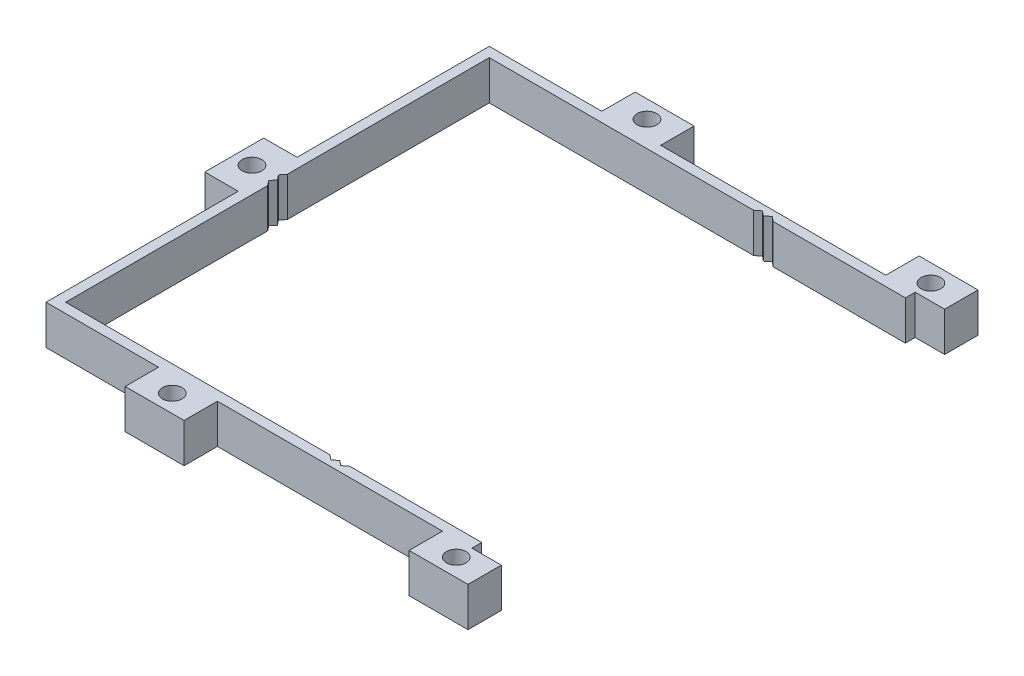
ISO-10303-21;
HEADER;
FILE_DESCRIPTION(('STEP AP214'),'2;1');
FILE_NAME('part.step','',(''),(''),'','','');
FILE_SCHEMA(('AUTOMOTIVE_DESIGN { 1 0 10303 214 1 1 1 1 }'));
ENDSEC;
DATA;
#1=APPLICATION_CONTEXT('core data for automotive mechanical design processes');
#2=APPLICATION_PROTOCOL_DEFINITION('international standard','automotive_design',2000,#1);
#3=PRODUCT_CONTEXT('',#1,'mechanical');
#4=PRODUCT('Part','Part','',(#3));
#5=PRODUCT_RELATED_PRODUCT_CATEGORY('part','',(#4));
#6=PRODUCT_DEFINITION_FORMATION('','',#4);
#7=PRODUCT_DEFINITION_CONTEXT('part definition',#1,'design');
#8=PRODUCT_DEFINITION('design','',#6,#7);
#9=PRODUCT_DEFINITION_SHAPE('','',#8);
#10=(LENGTH_UNIT() NAMED_UNIT(*) SI_UNIT(.MILLI.,.METRE.));
#11=(NAMED_UNIT(*) PLANE_ANGLE_UNIT() SI_UNIT($,.RADIAN.));
#12=(NAMED_UNIT(*) SI_UNIT($,.STERADIAN.) SOLID_ANGLE_UNIT());
#13=UNCERTAINTY_MEASURE_WITH_UNIT(LENGTH_MEASURE(1.E-05),#10,'distance_accuracy_value','');
#14=(GEOMETRIC_REPRESENTATION_CONTEXT(3) GLOBAL_UNCERTAINTY_ASSIGNED_CONTEXT((#13)) GLOBAL_UNIT_ASSIGNED_CONTEXT((#10,
#11,#12)) REPRESENTATION_CONTEXT('',''));
#15=CARTESIAN_POINT('',(0.,0.,0.));
#16=DIRECTION('',(0.,0.,1.));
#17=DIRECTION('',(1.,0.,0.));
#18=AXIS2_PLACEMENT_3D('',#15,#16,#17);
#19=CARTESIAN_POINT('',(87.35,-0.00999999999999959,112.95));
#20=DIRECTION('',(-1.,0.,0.));
#21=DIRECTION('',(0.,0.,1.));
#22=AXIS2_PLACEMENT_3D('',#19,#20,#21);
#23=PLANE('',#22);
#24=DIRECTION('',(0.,1.,0.));
#25=VECTOR('',#24,1.);
#26=CARTESIAN_POINT('',(87.35,-0.00999999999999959,112.95));
#27=LINE('',#26,#25);
#28=CARTESIAN_POINT('',(87.35,0.,112.95));
#29=VERTEX_POINT('',#28);
#30=CARTESIAN_POINT('',(87.35,20.,112.95));
#31=VERTEX_POINT('',#30);
#32=EDGE_CURVE('E41',#29,#31,#27,.T.);
#33=ORIENTED_EDGE('',*,*,#32,.T.);
#34=DIRECTION('',(0.,0.,1.));
#35=VECTOR('',#34,1.);
#36=CARTESIAN_POINT('',(87.35,20.,0.));
#37=LINE('',#36,#35);
#38=CARTESIAN_POINT('',(87.35,20.,129.95));
#39=VERTEX_POINT('',#38);
#40=EDGE_CURVE('E406',#31,#39,#37,.T.);
#41=ORIENTED_EDGE('',*,*,#40,.T.);
#42=DIRECTION('',(0.,1.,0.));
#43=VECTOR('',#42,1.);
#44=CARTESIAN_POINT('',(87.35,20.,129.95));
#45=LINE('',#44,#43);
#46=CARTESIAN_POINT('',(87.35,0.,129.95));
#47=VERTEX_POINT('',#46);
#48=EDGE_CURVE('E324',#47,#39,#45,.T.);
#49=ORIENTED_EDGE('',*,*,#48,.F.);
#50=DIRECTION('',(0.,0.,1.));
#51=VECTOR('',#50,1.);
#52=CARTESIAN_POINT('',(87.35,0.,0.));
#53=LINE('',#52,#51);
#54=EDGE_CURVE('E319',#29,#47,#53,.T.);
#55=ORIENTED_EDGE('',*,*,#54,.F.);
#56=EDGE_LOOP('',(#33,#41,#49,#55));
#57=FACE_BOUND('',#56,.T.);
#58=ADVANCED_FACE('F37',(#57),#23,.F.);
#59=CARTESIAN_POINT('',(72.35,-0.00999999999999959,112.95));
#60=DIRECTION('',(-1.,0.,0.));
#61=DIRECTION('',(0.,0.,1.));
#62=AXIS2_PLACEMENT_3D('',#59,#60,#61);
#63=PLANE('',#62);
#64=DIRECTION('',(0.,-1.,0.));
#65=VECTOR('',#64,1.);
#66=CARTESIAN_POINT('',(72.35,20.,107.95));
#67=LINE('',#66,#65);
#68=CARTESIAN_POINT('',(72.35,20.,107.95));
#69=VERTEX_POINT('',#68);
#70=CARTESIAN_POINT('',(72.35,0.,107.95));
#71=VERTEX_POINT('',#70);
#72=EDGE_CURVE('E327',#69,#71,#67,.T.);
#73=ORIENTED_EDGE('',*,*,#72,.F.);
#74=DIRECTION('',(0.,0.,1.));
#75=VECTOR('',#74,1.);
#76=CARTESIAN_POINT('',(72.35,20.,0.));
#77=LINE('',#76,#75);
#78=CARTESIAN_POINT('',(72.35,20.,112.95));
#79=VERTEX_POINT('',#78);
#80=EDGE_CURVE('E409',#69,#79,#77,.T.);
#81=ORIENTED_EDGE('',*,*,#80,.T.);
#82=DIRECTION('',(0.,1.,0.));
#83=VECTOR('',#82,1.);
#84=CARTESIAN_POINT('',(72.35,-0.00999999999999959,112.95));
#85=LINE('',#84,#83);
#86=CARTESIAN_POINT('',(72.35,0.,112.95));
#87=VERTEX_POINT('',#86);
#88=EDGE_CURVE('E342',#87,#79,#85,.T.);
#89=ORIENTED_EDGE('',*,*,#88,.F.);
#90=DIRECTION('',(0.,0.,1.));
#91=VECTOR('',#90,1.);
#92=CARTESIAN_POINT('',(72.35,0.,0.));
#93=LINE('',#92,#91);
#94=EDGE_CURVE('E334',#71,#87,#93,.T.);
#95=ORIENTED_EDGE('',*,*,#94,.F.);
#96=EDGE_LOOP('',(#73,#81,#89,#95));
#97=FACE_BOUND('',#96,.T.);
#98=ADVANCED_FACE('F818',(#97),#63,.F.);
#99=CARTESIAN_POINT('',(72.35,-0.00999999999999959,112.95));
#100=DIRECTION('',(0.,0.,1.));
#101=DIRECTION('',(1.,0.,0.));
#102=AXIS2_PLACEMENT_3D('',#99,#100,#101);
#103=PLANE('',#102);
#104=ORIENTED_EDGE('',*,*,#88,.T.);
#105=DIRECTION('',(1.,0.,0.));
#106=VECTOR('',#105,1.);
#107=CARTESIAN_POINT('',(0.,20.,112.95));
#108=LINE('',#107,#106);
#109=EDGE_CURVE('E341',#79,#31,#108,.T.);
#110=ORIENTED_EDGE('',*,*,#109,.T.);
#111=ORIENTED_EDGE('',*,*,#32,.F.);
#112=DIRECTION('',(1.,0.,0.));
#113=VECTOR('',#112,1.);
#114=CARTESIAN_POINT('',(0.,0.,112.95));
#115=LINE('',#114,#113);
#116=EDGE_CURVE('E328',#87,#29,#115,.T.);
#117=ORIENTED_EDGE('',*,*,#116,.F.);
#118=EDGE_LOOP('',(#104,#110,#111,#117));
#119=FACE_BOUND('',#118,.T.);
#120=ADVANCED_FACE('F339',(#119),#103,.F.);
#121=CARTESIAN_POINT('',(72.35,-0.00999999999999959,-112.95));
#122=DIRECTION('',(1.,0.,0.));
#123=DIRECTION('',(0.,0.,-1.));
#124=AXIS2_PLACEMENT_3D('',#121,#122,#123);
#125=PLANE('',#124);
#126=DIRECTION('',(0.,1.,0.));
#127=VECTOR('',#126,1.);
#128=CARTESIAN_POINT('',(72.35,20.,-107.95));
#129=LINE('',#128,#127);
#130=CARTESIAN_POINT('',(72.35,0.,-107.95));
#131=VERTEX_POINT('',#130);
#132=CARTESIAN_POINT('',(72.35,20.,-107.95));
#133=VERTEX_POINT('',#132);
#134=EDGE_CURVE('E423',#131,#133,#129,.T.);
#135=ORIENTED_EDGE('',*,*,#134,.F.);
#136=DIRECTION('',(0.,0.,-1.));
#137=VECTOR('',#136,1.);
#138=CARTESIAN_POINT('',(72.35,0.,0.));
#139=LINE('',#138,#137);
#140=CARTESIAN_POINT('',(72.35,0.,-112.95));
#141=VERTEX_POINT('',#140);
#142=EDGE_CURVE('E403',#131,#141,#139,.T.);
#143=ORIENTED_EDGE('',*,*,#142,.T.);
#144=DIRECTION('',(0.,1.,0.));
#145=VECTOR('',#144,1.);
#146=CARTESIAN_POINT('',(72.35,-0.00999999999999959,-112.95));
#147=LINE('',#146,#145);
#148=CARTESIAN_POINT('',(72.35,20.,-112.95));
#149=VERTEX_POINT('',#148);
#150=EDGE_CURVE('E47',#141,#149,#147,.T.);
#151=ORIENTED_EDGE('',*,*,#150,.T.);
#152=DIRECTION('',(0.,0.,-1.));
#153=VECTOR('',#152,1.);
#154=CARTESIAN_POINT('',(72.35,20.,0.));
#155=LINE('',#154,#153);
#156=EDGE_CURVE('E411',#133,#149,#155,.T.);
#157=ORIENTED_EDGE('',*,*,#156,.F.);
#158=EDGE_LOOP('',(#135,#143,#151,#157));
#159=FACE_BOUND('',#158,.T.);
#160=ADVANCED_FACE('F739',(#159),#125,.T.);
#161=CARTESIAN_POINT('',(87.35,-0.00999999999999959,-112.95));
#162=DIRECTION('',(1.,0.,0.));
#163=DIRECTION('',(0.,0.,-1.));
#164=AXIS2_PLACEMENT_3D('',#161,#162,#163);
#165=PLANE('',#164);
#166=DIRECTION('',(0.,1.,0.));
#167=VECTOR('',#166,1.);
#168=CARTESIAN_POINT('',(87.35,-0.00999999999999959,-112.95));
#169=LINE('',#168,#167);
#170=CARTESIAN_POINT('',(87.35,0.,-112.95));
#171=VERTEX_POINT('',#170);
#172=CARTESIAN_POINT('',(87.35,20.,-112.95));
#173=VERTEX_POINT('',#172);
#174=EDGE_CURVE('E11',#171,#173,#169,.T.);
#175=ORIENTED_EDGE('',*,*,#174,.F.);
#176=DIRECTION('',(0.,0.,-1.));
#177=VECTOR('',#176,1.);
#178=CARTESIAN_POINT('',(87.35,0.,0.));
#179=LINE('',#178,#177);
#180=CARTESIAN_POINT('',(87.35,0.,-129.95));
#181=VERTEX_POINT('',#180);
#182=EDGE_CURVE('E343',#171,#181,#179,.T.);
#183=ORIENTED_EDGE('',*,*,#182,.T.);
#184=DIRECTION('',(0.,-1.,0.));
#185=VECTOR('',#184,1.);
#186=CARTESIAN_POINT('',(87.35,20.,-129.95));
#187=LINE('',#186,#185);
#188=CARTESIAN_POINT('',(87.35,20.,-129.95));
#189=VERTEX_POINT('',#188);
#190=EDGE_CURVE('E425',#189,#181,#187,.T.);
#191=ORIENTED_EDGE('',*,*,#190,.F.);
#192=DIRECTION('',(0.,0.,-1.));
#193=VECTOR('',#192,1.);
#194=CARTESIAN_POINT('',(87.35,20.,0.));
#195=LINE('',#194,#193);
#196=EDGE_CURVE('E417',#173,#189,#195,.T.);
#197=ORIENTED_EDGE('',*,*,#196,.F.);
#198=EDGE_LOOP('',(#175,#183,#191,#197));
#199=FACE_BOUND('',#198,.T.);
#200=ADVANCED_FACE('F1350',(#199),#165,.T.);
#201=CARTESIAN_POINT('',(72.35,-0.00999999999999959,-112.95));
#202=DIRECTION('',(0.,0.,1.));
#203=DIRECTION('',(1.,0.,0.));
#204=AXIS2_PLACEMENT_3D('',#201,#202,#203);
#205=PLANE('',#204);
#206=ORIENTED_EDGE('',*,*,#150,.F.);
#207=DIRECTION('',(1.,0.,0.));
#208=VECTOR('',#207,1.);
#209=CARTESIAN_POINT('',(0.,0.,-112.95));
#210=LINE('',#209,#208);
#211=EDGE_CURVE('E345',#141,#171,#210,.T.);
#212=ORIENTED_EDGE('',*,*,#211,.T.);
#213=ORIENTED_EDGE('',*,*,#174,.T.);
#214=DIRECTION('',(1.,0.,0.));
#215=VECTOR('',#214,1.);
#216=CARTESIAN_POINT('',(0.,20.,-112.95));
#217=LINE('',#216,#215);
#218=EDGE_CURVE('E414',#149,#173,#217,.T.);
#219=ORIENTED_EDGE('',*,*,#218,.F.);
#220=EDGE_LOOP('',(#206,#212,#213,#219));
#221=FACE_BOUND('',#220,.T.);
#222=ADVANCED_FACE('F742',(#221),#205,.T.);
#223=CARTESIAN_POINT('',(-72.35,10.,120.95));
#224=DIRECTION('',(0.,1.,0.));
#225=DIRECTION('',(0.,0.,-1.));
#226=AXIS2_PLACEMENT_3D('',#223,#224,#225);
#227=PLANE('',#226);
#228=CARTESIAN_POINT('',(-72.35,10.,120.95));
#229=DIRECTION('',(0.,-1.,0.));
#230=DIRECTION('',(0.,0.,-1.));
#231=AXIS2_PLACEMENT_3D('',#228,#229,#230);
#232=CIRCLE('',#231,5.00000000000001);
#233=CARTESIAN_POINT('',(-72.35,10.,115.95));
#234=VERTEX_POINT('',#233);
#235=EDGE_CURVE('E474',#234,#234,#232,.T.);
#236=ORIENTED_EDGE('',*,*,#235,.F.);
#237=EDGE_LOOP('',(#236));
#238=FACE_BOUND('',#237,.T.);
#239=CARTESIAN_POINT('',(-72.35,10.,120.95));
#240=DIRECTION('',(0.,1.,0.));
#241=DIRECTION('',(0.,0.,1.));
#242=AXIS2_PLACEMENT_3D('',#239,#240,#241);
#243=CIRCLE('',#242,2.);
#244=CARTESIAN_POINT('',(-72.35,10.,122.95));
#245=VERTEX_POINT('',#244);
#246=EDGE_CURVE('E478',#245,#245,#243,.F.);
#247=ORIENTED_EDGE('',*,*,#246,.T.);
#248=EDGE_LOOP('',(#247));
#249=FACE_BOUND('',#248,.T.);
#250=ADVANCED_FACE('F704',(#238,#249),#227,.T.);
#251=CARTESIAN_POINT('',(72.35,10.,120.95));
#252=DIRECTION('',(0.,1.,0.));
#253=DIRECTION('',(0.,0.,-1.));
#254=AXIS2_PLACEMENT_3D('',#251,#252,#253);
#255=PLANE('',#254);
#256=CARTESIAN_POINT('',(72.35,10.,120.95));
#257=DIRECTION('',(0.,1.,0.));
#258=DIRECTION('',(0.,0.,1.));
#259=AXIS2_PLACEMENT_3D('',#256,#257,#258);
#260=CIRCLE('',#259,2.);
#261=CARTESIAN_POINT('',(72.35,10.,122.95));
#262=VERTEX_POINT('',#261);
#263=EDGE_CURVE('E464',#262,#262,#260,.T.);
#264=ORIENTED_EDGE('',*,*,#263,.F.);
#265=EDGE_LOOP('',(#264));
#266=FACE_BOUND('',#265,.T.);
#267=CARTESIAN_POINT('',(72.35,10.,120.95));
#268=DIRECTION('',(0.,1.,0.));
#269=DIRECTION('',(0.,0.,-1.));
#270=AXIS2_PLACEMENT_3D('',#267,#268,#269);
#271=CIRCLE('',#270,5.00000000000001);
#272=CARTESIAN_POINT('',(72.35,10.,115.95));
#273=VERTEX_POINT('',#272);
#274=EDGE_CURVE('E461',#273,#273,#271,.T.);
#275=ORIENTED_EDGE('',*,*,#274,.T.);
#276=EDGE_LOOP('',(#275));
#277=FACE_BOUND('',#276,.T.);
#278=ADVANCED_FACE('F700',(#266,#277),#255,.T.);
#279=CARTESIAN_POINT('',(-72.35,10.,-120.95));
#280=DIRECTION('',(0.,1.,0.));
#281=DIRECTION('',(0.,0.,1.));
#282=AXIS2_PLACEMENT_3D('',#279,#280,#281);
#283=PLANE('',#282);
#284=CARTESIAN_POINT('',(-72.35,10.,-120.95));
#285=DIRECTION('',(0.,1.,0.));
#286=DIRECTION('',(0.,0.,1.));
#287=AXIS2_PLACEMENT_3D('',#284,#285,#286);
#288=CIRCLE('',#287,2.);
#289=CARTESIAN_POINT('',(-72.35,10.,-118.95));
#290=VERTEX_POINT('',#289);
#291=EDGE_CURVE('E485',#290,#290,#288,.T.);
#292=ORIENTED_EDGE('',*,*,#291,.F.);
#293=EDGE_LOOP('',(#292));
#294=FACE_BOUND('',#293,.T.);
#295=CARTESIAN_POINT('',(-72.35,10.,-120.95));
#296=DIRECTION('',(0.,1.,0.));
#297=DIRECTION('',(0.,0.,1.));
#298=AXIS2_PLACEMENT_3D('',#295,#296,#297);
#299=CIRCLE('',#298,5.00000000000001);
#300=CARTESIAN_POINT('',(-72.35,10.,-115.95));
#301=VERTEX_POINT('',#300);
#302=EDGE_CURVE('E481',#301,#301,#299,.T.);
#303=ORIENTED_EDGE('',*,*,#302,.T.);
#304=EDGE_LOOP('',(#303));
#305=FACE_BOUND('',#304,.T.);
#306=ADVANCED_FACE('F703',(#294,#305),#283,.T.);
#307=CARTESIAN_POINT('',(72.35,10.,-120.95));
#308=DIRECTION('',(0.,1.,0.));
#309=DIRECTION('',(0.,0.,1.));
#310=AXIS2_PLACEMENT_3D('',#307,#308,#309);
#311=PLANE('',#310);
#312=CARTESIAN_POINT('',(72.35,10.,-120.95));
#313=DIRECTION('',(0.,-1.,0.));
#314=DIRECTION('',(0.,0.,1.));
#315=AXIS2_PLACEMENT_3D('',#312,#313,#314);
#316=CIRCLE('',#315,5.00000000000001);
#317=CARTESIAN_POINT('',(72.35,10.,-115.95));
#318=VERTEX_POINT('',#317);
#319=EDGE_CURVE('E467',#318,#318,#316,.T.);
#320=ORIENTED_EDGE('',*,*,#319,.F.);
#321=EDGE_LOOP('',(#320));
#322=FACE_BOUND('',#321,.T.);
#323=CARTESIAN_POINT('',(72.35,10.,-120.95));
#324=DIRECTION('',(0.,1.,0.));
#325=DIRECTION('',(0.,0.,1.));
#326=AXIS2_PLACEMENT_3D('',#323,#324,#325);
#327=CIRCLE('',#326,2.);
#328=CARTESIAN_POINT('',(72.35,10.,-118.95));
#329=VERTEX_POINT('',#328);
#330=EDGE_CURVE('E471',#329,#329,#327,.F.);
#331=ORIENTED_EDGE('',*,*,#330,.T.);
#332=EDGE_LOOP('',(#331));
#333=FACE_BOUND('',#332,.T.);
#334=ADVANCED_FACE('F1307',(#322,#333),#311,.T.);
#335=CARTESIAN_POINT('',(-152.7,10.,0.));
#336=DIRECTION('',(0.,1.,0.));
#337=DIRECTION('',(0.,0.,1.));
#338=AXIS2_PLACEMENT_3D('',#335,#336,#337);
#339=PLANE('',#338);
#340=CARTESIAN_POINT('',(-152.7,10.,0.));
#341=DIRECTION('',(0.,1.,0.));
#342=DIRECTION('',(0.,0.,1.));
#343=AXIS2_PLACEMENT_3D('',#340,#341,#342);
#344=CIRCLE('',#343,2.);
#345=CARTESIAN_POINT('',(-152.7,10.,2.00000000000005));
#346=VERTEX_POINT('',#345);
#347=EDGE_CURVE('E429',#346,#346,#344,.T.);
#348=ORIENTED_EDGE('',*,*,#347,.F.);
#349=EDGE_LOOP('',(#348));
#350=FACE_BOUND('',#349,.T.);
#351=CARTESIAN_POINT('',(-152.7,10.,0.));
#352=DIRECTION('',(0.,1.,0.));
#353=DIRECTION('',(0.,0.,1.));
#354=AXIS2_PLACEMENT_3D('',#351,#352,#353);
#355=CIRCLE('',#354,5.00000000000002);
#356=CARTESIAN_POINT('',(-152.7,10.,5.00000000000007));
#357=VERTEX_POINT('',#356);
#358=EDGE_CURVE('E434',#357,#357,#355,.T.);
#359=ORIENTED_EDGE('',*,*,#358,.T.);
#360=EDGE_LOOP('',(#359));
#361=FACE_BOUND('',#360,.T.);
#362=ADVANCED_FACE('F1297',(#350,#361),#339,.T.);
#363=CARTESIAN_POINT('',(-152.7,10.,0.));
#364=DIRECTION('',(0.,1.,0.));
#365=DIRECTION('',(0.,0.,1.));
#366=AXIS2_PLACEMENT_3D('',#363,#364,#365);
#367=CYLINDRICAL_SURFACE('',#366,5.00000000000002);
#368=ORIENTED_EDGE('',*,*,#358,.F.);
#369=EDGE_LOOP('',(#368));
#370=FACE_BOUND('',#369,.T.);
#371=CARTESIAN_POINT('',(-152.7,20.,0.));
#372=DIRECTION('',(0.,1.,0.));
#373=DIRECTION('',(0.,0.,1.));
#374=AXIS2_PLACEMENT_3D('',#371,#372,#373);
#375=CIRCLE('',#374,5.00000000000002);
#376=CARTESIAN_POINT('',(-152.7,20.,5.00000000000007));
#377=VERTEX_POINT('',#376);
#378=EDGE_CURVE('E433',#377,#377,#375,.T.);
#379=ORIENTED_EDGE('',*,*,#378,.T.);
#380=EDGE_LOOP('',(#379));
#381=FACE_BOUND('',#380,.T.);
#382=ADVANCED_FACE('F712',(#370,#381),#367,.F.);
#383=CARTESIAN_POINT('',(72.35,10.,120.95));
#384=DIRECTION('',(0.,1.,0.));
#385=DIRECTION('',(0.,0.,1.));
#386=AXIS2_PLACEMENT_3D('',#383,#384,#385);
#387=CYLINDRICAL_SURFACE('',#386,5.00000000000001);
#388=ORIENTED_EDGE('',*,*,#274,.F.);
#389=EDGE_LOOP('',(#388));
#390=FACE_BOUND('',#389,.T.);
#391=CARTESIAN_POINT('',(72.35,20.,120.95));
#392=DIRECTION('',(0.,1.,0.));
#393=DIRECTION('',(0.,0.,-1.));
#394=AXIS2_PLACEMENT_3D('',#391,#392,#393);
#395=CIRCLE('',#394,5.00000000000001);
#396=CARTESIAN_POINT('',(72.35,20.,115.95));
#397=VERTEX_POINT('',#396);
#398=EDGE_CURVE('E460',#397,#397,#395,.T.);
#399=ORIENTED_EDGE('',*,*,#398,.T.);
#400=EDGE_LOOP('',(#399));
#401=FACE_BOUND('',#400,.T.);
#402=ADVANCED_FACE('F708',(#390,#401),#387,.F.);
#403=CARTESIAN_POINT('',(72.35,10.,-120.95));
#404=DIRECTION('',(0.,1.,0.));
#405=DIRECTION('',(0.,0.,1.));
#406=AXIS2_PLACEMENT_3D('',#403,#404,#405);
#407=CYLINDRICAL_SURFACE('',#406,5.00000000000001);
#408=ORIENTED_EDGE('',*,*,#319,.T.);
#409=EDGE_LOOP('',(#408));
#410=FACE_BOUND('',#409,.T.);
#411=CARTESIAN_POINT('',(72.35,20.,-120.95));
#412=DIRECTION('',(0.,-1.,0.));
#413=DIRECTION('',(0.,0.,1.));
#414=AXIS2_PLACEMENT_3D('',#411,#412,#413);
#415=CIRCLE('',#414,5.00000000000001);
#416=CARTESIAN_POINT('',(72.35,20.,-115.95));
#417=VERTEX_POINT('',#416);
#418=EDGE_CURVE('E470',#417,#417,#415,.T.);
#419=ORIENTED_EDGE('',*,*,#418,.F.);
#420=EDGE_LOOP('',(#419));
#421=FACE_BOUND('',#420,.T.);
#422=ADVANCED_FACE('F711',(#410,#421),#407,.F.);
#423=CARTESIAN_POINT('',(-72.35,10.,120.95));
#424=DIRECTION('',(0.,1.,0.));
#425=DIRECTION('',(0.,0.,1.));
#426=AXIS2_PLACEMENT_3D('',#423,#424,#425);
#427=CYLINDRICAL_SURFACE('',#426,5.00000000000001);
#428=ORIENTED_EDGE('',*,*,#235,.T.);
#429=EDGE_LOOP('',(#428));
#430=FACE_BOUND('',#429,.T.);
#431=CARTESIAN_POINT('',(-72.35,20.,120.95));
#432=DIRECTION('',(0.,-1.,0.));
#433=DIRECTION('',(0.,0.,-1.));
#434=AXIS2_PLACEMENT_3D('',#431,#432,#433);
#435=CIRCLE('',#434,5.00000000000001);
#436=CARTESIAN_POINT('',(-72.35,20.,115.95));
#437=VERTEX_POINT('',#436);
#438=EDGE_CURVE('E477',#437,#437,#435,.T.);
#439=ORIENTED_EDGE('',*,*,#438,.F.);
#440=EDGE_LOOP('',(#439));
#441=FACE_BOUND('',#440,.T.);
#442=ADVANCED_FACE('F1263',(#430,#441),#427,.F.);
#443=CARTESIAN_POINT('',(-72.35,10.,-120.95));
#444=DIRECTION('',(0.,1.,0.));
#445=DIRECTION('',(0.,0.,1.));
#446=AXIS2_PLACEMENT_3D('',#443,#444,#445);
#447=CYLINDRICAL_SURFACE('',#446,5.00000000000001);
#448=ORIENTED_EDGE('',*,*,#302,.F.);
#449=EDGE_LOOP('',(#448));
#450=FACE_BOUND('',#449,.T.);
#451=CARTESIAN_POINT('',(-72.35,20.,-120.95));
#452=DIRECTION('',(0.,1.,0.));
#453=DIRECTION('',(0.,0.,1.));
#454=AXIS2_PLACEMENT_3D('',#451,#452,#453);
#455=CIRCLE('',#454,5.00000000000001);
#456=CARTESIAN_POINT('',(-72.35,20.,-115.95));
#457=VERTEX_POINT('',#456);
#458=EDGE_CURVE('E484',#457,#457,#455,.T.);
#459=ORIENTED_EDGE('',*,*,#458,.T.);
#460=EDGE_LOOP('',(#459));
#461=FACE_BOUND('',#460,.T.);
#462=ADVANCED_FACE('F1255',(#450,#461),#447,.F.);
#463=CARTESIAN_POINT('',(0.,20.,-112.95));
#464=DIRECTION('',(0.,0.,1.));
#465=DIRECTION('',(1.,0.,0.));
#466=AXIS2_PLACEMENT_3D('',#463,#464,#465);
#467=PLANE('',#466);
#468=DIRECTION('',(-1.,0.,0.));
#469=VECTOR('',#468,1.);
#470=CARTESIAN_POINT('',(0.,0.,-112.95));
#471=LINE('',#470,#469);
#472=CARTESIAN_POINT('',(57.35,0.,-112.95));
#473=VERTEX_POINT('',#472);
#474=CARTESIAN_POINT('',(-57.35,0.,-112.95));
#475=VERTEX_POINT('',#474);
#476=EDGE_CURVE('E360',#473,#475,#471,.T.);
#477=ORIENTED_EDGE('',*,*,#476,.T.);
#478=DIRECTION('',(0.,-1.,0.));
#479=VECTOR('',#478,1.);
#480=CARTESIAN_POINT('',(-57.35,20.,-112.95));
#481=LINE('',#480,#479);
#482=CARTESIAN_POINT('',(-57.35,20.,-112.95));
#483=VERTEX_POINT('',#482);
#484=EDGE_CURVE('E679',#483,#475,#481,.T.);
#485=ORIENTED_EDGE('',*,*,#484,.F.);
#486=DIRECTION('',(-1.,0.,0.));
#487=VECTOR('',#486,1.);
#488=CARTESIAN_POINT('',(0.,20.,-112.95));
#489=LINE('',#488,#487);
#490=CARTESIAN_POINT('',(57.35,20.,-112.95));
#491=VERTEX_POINT('',#490);
#492=EDGE_CURVE('E386',#491,#483,#489,.T.);
#493=ORIENTED_EDGE('',*,*,#492,.F.);
#494=DIRECTION('',(0.,-1.,0.));
#495=VECTOR('',#494,1.);
#496=CARTESIAN_POINT('',(57.35,20.,-112.95));
#497=LINE('',#496,#495);
#498=EDGE_CURVE('E682',#491,#473,#497,.T.);
#499=ORIENTED_EDGE('',*,*,#498,.T.);
#500=EDGE_LOOP('',(#477,#485,#493,#499));
#501=FACE_BOUND('',#500,.T.);
#502=ADVANCED_FACE('F759',(#501),#467,.F.);
#503=CARTESIAN_POINT('',(-57.35,20.,0.));
#504=DIRECTION('',(-1.,0.,0.));
#505=DIRECTION('',(0.,0.,1.));
#506=AXIS2_PLACEMENT_3D('',#503,#504,#505);
#507=PLANE('',#506);
#508=DIRECTION('',(0.,0.,-1.));
#509=VECTOR('',#508,1.);
#510=CARTESIAN_POINT('',(-57.35,0.,0.));
#511=LINE('',#510,#509);
#512=CARTESIAN_POINT('',(-57.35,0.,-129.95));
#513=VERTEX_POINT('',#512);
#514=EDGE_CURVE('E619',#475,#513,#511,.T.);
#515=ORIENTED_EDGE('',*,*,#514,.T.);
#516=DIRECTION('',(0.,-1.,0.));
#517=VECTOR('',#516,1.);
#518=CARTESIAN_POINT('',(-57.35,20.,-129.95));
#519=LINE('',#518,#517);
#520=CARTESIAN_POINT('',(-57.35,20.,-129.95));
#521=VERTEX_POINT('',#520);
#522=EDGE_CURVE('E676',#521,#513,#519,.T.);
#523=ORIENTED_EDGE('',*,*,#522,.F.);
#524=DIRECTION('',(0.,0.,-1.));
#525=VECTOR('',#524,1.);
#526=CARTESIAN_POINT('',(-57.35,20.,0.));
#527=LINE('',#526,#525);
#528=EDGE_CURVE('E595',#483,#521,#527,.T.);
#529=ORIENTED_EDGE('',*,*,#528,.F.);
#530=ORIENTED_EDGE('',*,*,#484,.T.);
#531=EDGE_LOOP('',(#515,#523,#529,#530));
#532=FACE_BOUND('',#531,.T.);
#533=ADVANCED_FACE('F762',(#532),#507,.F.);
#534=CARTESIAN_POINT('',(0.,20.,-129.95));
#535=DIRECTION('',(0.,0.,1.));
#536=DIRECTION('',(1.,0.,0.));
#537=AXIS2_PLACEMENT_3D('',#534,#535,#536);
#538=PLANE('',#537);
#539=DIRECTION('',(-1.,0.,0.));
#540=VECTOR('',#539,1.);
#541=CARTESIAN_POINT('',(0.,0.,-129.95));
#542=LINE('',#541,#540);
#543=CARTESIAN_POINT('',(-87.35,0.,-129.95));
#544=VERTEX_POINT('',#543);
#545=EDGE_CURVE('E622',#513,#544,#542,.T.);
#546=ORIENTED_EDGE('',*,*,#545,.T.);
#547=DIRECTION('',(0.,-1.,0.));
#548=VECTOR('',#547,1.);
#549=CARTESIAN_POINT('',(-87.35,20.,-129.95));
#550=LINE('',#549,#548);
#551=CARTESIAN_POINT('',(-87.35,20.,-129.95));
#552=VERTEX_POINT('',#551);
#553=EDGE_CURVE('E673',#552,#544,#550,.T.);
#554=ORIENTED_EDGE('',*,*,#553,.F.);
#555=DIRECTION('',(-1.,0.,0.));
#556=VECTOR('',#555,1.);
#557=CARTESIAN_POINT('',(0.,20.,-129.95));
#558=LINE('',#557,#556);
#559=EDGE_CURVE('E598',#521,#552,#558,.T.);
#560=ORIENTED_EDGE('',*,*,#559,.F.);
#561=ORIENTED_EDGE('',*,*,#522,.T.);
#562=EDGE_LOOP('',(#546,#554,#560,#561));
#563=FACE_BOUND('',#562,.T.);
#564=ADVANCED_FACE('F764',(#563),#538,.F.);
#565=CARTESIAN_POINT('',(-87.35,20.,0.));
#566=DIRECTION('',(1.,0.,0.));
#567=DIRECTION('',(0.,0.,-1.));
#568=AXIS2_PLACEMENT_3D('',#565,#566,#567);
#569=PLANE('',#568);
#570=DIRECTION('',(0.,0.,1.));
#571=VECTOR('',#570,1.);
#572=CARTESIAN_POINT('',(-87.35,0.,0.));
#573=LINE('',#572,#571);
#574=CARTESIAN_POINT('',(-87.35,0.,-112.95));
#575=VERTEX_POINT('',#574);
#576=EDGE_CURVE('E358',#544,#575,#573,.T.);
#577=ORIENTED_EDGE('',*,*,#576,.T.);
#578=DIRECTION('',(0.,-1.,0.));
#579=VECTOR('',#578,1.);
#580=CARTESIAN_POINT('',(-87.35,20.,-112.95));
#581=LINE('',#580,#579);
#582=CARTESIAN_POINT('',(-87.35,20.,-112.95));
#583=VERTEX_POINT('',#582);
#584=EDGE_CURVE('E670',#583,#575,#581,.T.);
#585=ORIENTED_EDGE('',*,*,#584,.F.);
#586=DIRECTION('',(0.,0.,1.));
#587=VECTOR('',#586,1.);
#588=CARTESIAN_POINT('',(-87.35,20.,0.));
#589=LINE('',#588,#587);
#590=EDGE_CURVE('E384',#552,#583,#589,.T.);
#591=ORIENTED_EDGE('',*,*,#590,.F.);
#592=ORIENTED_EDGE('',*,*,#553,.T.);
#593=EDGE_LOOP('',(#577,#585,#591,#592));
#594=FACE_BOUND('',#593,.T.);
#595=ADVANCED_FACE('F769',(#594),#569,.F.);
#596=CARTESIAN_POINT('',(-144.7,0.,-112.95));
#597=VERTEX_POINT('',#596);
#598=EDGE_CURVE('E355',#575,#597,#471,.T.);
#599=ORIENTED_EDGE('',*,*,#598,.T.);
#600=DIRECTION('',(0.,-1.,0.));
#601=VECTOR('',#600,1.);
#602=CARTESIAN_POINT('',(-144.7,20.,-112.95));
#603=LINE('',#602,#601);
#604=CARTESIAN_POINT('',(-144.7,20.,-112.95));
#605=VERTEX_POINT('',#604);
#606=EDGE_CURVE('E667',#605,#597,#603,.T.);
#607=ORIENTED_EDGE('',*,*,#606,.F.);
#608=EDGE_CURVE('E381',#583,#605,#489,.T.);
#609=ORIENTED_EDGE('',*,*,#608,.F.);
#610=ORIENTED_EDGE('',*,*,#584,.T.);
#611=EDGE_LOOP('',(#599,#607,#609,#610));
#612=FACE_BOUND('',#611,.T.);
#613=ADVANCED_FACE('F771',(#612),#467,.F.);
#614=CARTESIAN_POINT('',(-144.7,20.,0.));
#615=DIRECTION('',(1.,0.,0.));
#616=DIRECTION('',(0.,0.,-1.));
#617=AXIS2_PLACEMENT_3D('',#614,#615,#616);
#618=PLANE('',#617);
#619=DIRECTION('',(0.,-1.,0.));
#620=VECTOR('',#619,1.);
#621=CARTESIAN_POINT('',(-144.7,20.,-14.9999999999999));
#622=LINE('',#621,#620);
#623=CARTESIAN_POINT('',(-144.7,20.,-14.9999999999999));
#624=VERTEX_POINT('',#623);
#625=CARTESIAN_POINT('',(-144.7,0.,-14.9999999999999));
#626=VERTEX_POINT('',#625);
#627=EDGE_CURVE('E56',#624,#626,#622,.T.);
#628=ORIENTED_EDGE('',*,*,#627,.F.);
#629=DIRECTION('',(0.,0.,1.));
#630=VECTOR('',#629,1.);
#631=CARTESIAN_POINT('',(-144.7,20.,0.));
#632=LINE('',#631,#630);
#633=EDGE_CURVE('E397',#605,#624,#632,.T.);
#634=ORIENTED_EDGE('',*,*,#633,.F.);
#635=ORIENTED_EDGE('',*,*,#606,.T.);
#636=DIRECTION('',(0.,0.,1.));
#637=VECTOR('',#636,1.);
#638=CARTESIAN_POINT('',(-144.7,0.,0.));
#639=LINE('',#638,#637);
#640=EDGE_CURVE('E371',#597,#626,#639,.T.);
#641=ORIENTED_EDGE('',*,*,#640,.T.);
#642=EDGE_LOOP('',(#628,#634,#635,#641));
#643=FACE_BOUND('',#642,.T.);
#644=ADVANCED_FACE('F773',(#643),#618,.F.);
#645=CARTESIAN_POINT('',(0.,20.,-14.9999999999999));
#646=DIRECTION('',(0.,0.,1.));
#647=DIRECTION('',(1.,0.,0.));
#648=AXIS2_PLACEMENT_3D('',#645,#646,#647);
#649=PLANE('',#648);
#650=DIRECTION('',(-1.,0.,0.));
#651=VECTOR('',#650,1.);
#652=CARTESIAN_POINT('',(0.,0.,-14.9999999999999));
#653=LINE('',#652,#651);
#654=CARTESIAN_POINT('',(-161.7,0.,-14.9999999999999));
#655=VERTEX_POINT('',#654);
#656=EDGE_CURVE('E437',#626,#655,#653,.T.);
#657=ORIENTED_EDGE('',*,*,#656,.T.);
#658=DIRECTION('',(0.,-1.,0.));
#659=VECTOR('',#658,1.);
#660=CARTESIAN_POINT('',(-161.7,20.,-14.9999999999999));
#661=LINE('',#660,#659);
#662=CARTESIAN_POINT('',(-161.7,20.,-14.9999999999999));
#663=VERTEX_POINT('',#662);
#664=EDGE_CURVE('E457',#663,#655,#661,.T.);
#665=ORIENTED_EDGE('',*,*,#664,.F.);
#666=DIRECTION('',(-1.,0.,0.));
#667=VECTOR('',#666,1.);
#668=CARTESIAN_POINT('',(0.,20.,-14.9999999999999));
#669=LINE('',#668,#667);
#670=EDGE_CURVE('E72',#624,#663,#669,.T.);
#671=ORIENTED_EDGE('',*,*,#670,.F.);
#672=ORIENTED_EDGE('',*,*,#627,.T.);
#673=EDGE_LOOP('',(#657,#665,#671,#672));
#674=FACE_BOUND('',#673,.T.);
#675=ADVANCED_FACE('F775',(#674),#649,.F.);
#676=CARTESIAN_POINT('',(-161.7,20.,0.));
#677=DIRECTION('',(1.,0.,0.));
#678=DIRECTION('',(0.,0.,-1.));
#679=AXIS2_PLACEMENT_3D('',#676,#677,#678);
#680=PLANE('',#679);
#681=DIRECTION('',(0.,0.,1.));
#682=VECTOR('',#681,1.);
#683=CARTESIAN_POINT('',(-161.7,0.,0.));
#684=LINE('',#683,#682);
#685=CARTESIAN_POINT('',(-161.7,0.,15.0000000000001));
#686=VERTEX_POINT('',#685);
#687=EDGE_CURVE('E79',#655,#686,#684,.T.);
#688=ORIENTED_EDGE('',*,*,#687,.T.);
#689=DIRECTION('',(0.,-1.,0.));
#690=VECTOR('',#689,1.);
#691=CARTESIAN_POINT('',(-161.7,20.,15.0000000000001));
#692=LINE('',#691,#690);
#693=CARTESIAN_POINT('',(-161.7,20.,15.0000000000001));
#694=VERTEX_POINT('',#693);
#695=EDGE_CURVE('E455',#694,#686,#692,.T.);
#696=ORIENTED_EDGE('',*,*,#695,.F.);
#697=DIRECTION('',(0.,0.,1.));
#698=VECTOR('',#697,1.);
#699=CARTESIAN_POINT('',(-161.7,20.,0.));
#700=LINE('',#699,#698);
#701=EDGE_CURVE('E442',#663,#694,#700,.T.);
#702=ORIENTED_EDGE('',*,*,#701,.F.);
#703=ORIENTED_EDGE('',*,*,#664,.T.);
#704=EDGE_LOOP('',(#688,#696,#702,#703));
#705=FACE_BOUND('',#704,.T.);
#706=ADVANCED_FACE('F777',(#705),#680,.F.);
#707=CARTESIAN_POINT('',(0.,20.,15.0000000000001));
#708=DIRECTION('',(0.,0.,-1.));
#709=DIRECTION('',(-1.,0.,0.));
#710=AXIS2_PLACEMENT_3D('',#707,#708,#709);
#711=PLANE('',#710);
#712=DIRECTION('',(1.,0.,0.));
#713=VECTOR('',#712,1.);
#714=CARTESIAN_POINT('',(0.,0.,15.0000000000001));
#715=LINE('',#714,#713);
#716=CARTESIAN_POINT('',(-144.7,0.,15.0000000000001));
#717=VERTEX_POINT('',#716);
#718=EDGE_CURVE('E449',#686,#717,#715,.T.);
#719=ORIENTED_EDGE('',*,*,#718,.T.);
#720=DIRECTION('',(0.,-1.,0.));
#721=VECTOR('',#720,1.);
#722=CARTESIAN_POINT('',(-144.7,20.,15.0000000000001));
#723=LINE('',#722,#721);
#724=CARTESIAN_POINT('',(-144.7,20.,15.0000000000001));
#725=VERTEX_POINT('',#724);
#726=EDGE_CURVE('E446',#725,#717,#723,.T.);
#727=ORIENTED_EDGE('',*,*,#726,.F.);
#728=DIRECTION('',(1.,0.,0.));
#729=VECTOR('',#728,1.);
#730=CARTESIAN_POINT('',(0.,20.,15.0000000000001));
#731=LINE('',#730,#729);
#732=EDGE_CURVE('E444',#694,#725,#731,.T.);
#733=ORIENTED_EDGE('',*,*,#732,.F.);
#734=ORIENTED_EDGE('',*,*,#695,.T.);
#735=EDGE_LOOP('',(#719,#727,#733,#734));
#736=FACE_BOUND('',#735,.T.);
#737=ADVANCED_FACE('F784',(#736),#711,.F.);
#738=CARTESIAN_POINT('',(-144.7,20.,112.95));
#739=VERTEX_POINT('',#738);
#740=EDGE_CURVE('E385',#725,#739,#632,.T.);
#741=ORIENTED_EDGE('',*,*,#740,.F.);
#742=ORIENTED_EDGE('',*,*,#726,.T.);
#743=CARTESIAN_POINT('',(-144.7,0.,112.95));
#744=VERTEX_POINT('',#743);
#745=EDGE_CURVE('E359',#717,#744,#639,.T.);
#746=ORIENTED_EDGE('',*,*,#745,.T.);
#747=DIRECTION('',(0.,-1.,0.));
#748=VECTOR('',#747,1.);
#749=CARTESIAN_POINT('',(-144.7,20.,112.95));
#750=LINE('',#749,#748);
#751=EDGE_CURVE('E664',#739,#744,#750,.T.);
#752=ORIENTED_EDGE('',*,*,#751,.F.);
#753=EDGE_LOOP('',(#741,#742,#746,#752));
#754=FACE_BOUND('',#753,.T.);
#755=ADVANCED_FACE('F787',(#754),#618,.F.);
#756=CARTESIAN_POINT('',(0.,20.,112.95));
#757=DIRECTION('',(0.,0.,1.));
#758=DIRECTION('',(1.,0.,0.));
#759=AXIS2_PLACEMENT_3D('',#756,#757,#758);
#760=PLANE('',#759);
#761=DIRECTION('',(-1.,0.,0.));
#762=VECTOR('',#761,1.);
#763=CARTESIAN_POINT('',(0.,0.,112.95));
#764=LINE('',#763,#762);
#765=CARTESIAN_POINT('',(-87.35,0.,112.95));
#766=VERTEX_POINT('',#765);
#767=EDGE_CURVE('E368',#766,#744,#764,.T.);
#768=ORIENTED_EDGE('',*,*,#767,.F.);
#769=DIRECTION('',(0.,-1.,0.));
#770=VECTOR('',#769,1.);
#771=CARTESIAN_POINT('',(-87.35,20.,112.95));
#772=LINE('',#771,#770);
#773=CARTESIAN_POINT('',(-87.35,20.,112.95));
#774=VERTEX_POINT('',#773);
#775=EDGE_CURVE('E662',#774,#766,#772,.T.);
#776=ORIENTED_EDGE('',*,*,#775,.F.);
#777=DIRECTION('',(-1.,0.,0.));
#778=VECTOR('',#777,1.);
#779=CARTESIAN_POINT('',(0.,20.,112.95));
#780=LINE('',#779,#778);
#781=EDGE_CURVE('E395',#774,#739,#780,.T.);
#782=ORIENTED_EDGE('',*,*,#781,.T.);
#783=ORIENTED_EDGE('',*,*,#751,.T.);
#784=EDGE_LOOP('',(#768,#776,#782,#783));
#785=FACE_BOUND('',#784,.T.);
#786=ADVANCED_FACE('F39',(#785),#760,.T.);
#787=CARTESIAN_POINT('',(-87.35,20.,0.));
#788=DIRECTION('',(-1.,0.,0.));
#789=DIRECTION('',(0.,0.,1.));
#790=AXIS2_PLACEMENT_3D('',#787,#788,#789);
#791=PLANE('',#790);
#792=DIRECTION('',(0.,0.,-1.));
#793=VECTOR('',#792,1.);
#794=CARTESIAN_POINT('',(-87.35,0.,0.));
#795=LINE('',#794,#793);
#796=CARTESIAN_POINT('',(-87.35,0.,129.95));
#797=VERTEX_POINT('',#796);
#798=EDGE_CURVE('E372',#797,#766,#795,.T.);
#799=ORIENTED_EDGE('',*,*,#798,.F.);
#800=DIRECTION('',(0.,-1.,0.));
#801=VECTOR('',#800,1.);
#802=CARTESIAN_POINT('',(-87.35,20.,129.95));
#803=LINE('',#802,#801);
#804=CARTESIAN_POINT('',(-87.35,20.,129.95));
#805=VERTEX_POINT('',#804);
#806=EDGE_CURVE('E660',#805,#797,#803,.T.);
#807=ORIENTED_EDGE('',*,*,#806,.F.);
#808=DIRECTION('',(0.,0.,-1.));
#809=VECTOR('',#808,1.);
#810=CARTESIAN_POINT('',(-87.35,20.,0.));
#811=LINE('',#810,#809);
#812=EDGE_CURVE('E398',#805,#774,#811,.T.);
#813=ORIENTED_EDGE('',*,*,#812,.T.);
#814=ORIENTED_EDGE('',*,*,#775,.T.);
#815=EDGE_LOOP('',(#799,#807,#813,#814));
#816=FACE_BOUND('',#815,.T.);
#817=ADVANCED_FACE('F794',(#816),#791,.T.);
#818=CARTESIAN_POINT('',(0.,20.,129.95));
#819=DIRECTION('',(0.,0.,1.));
#820=DIRECTION('',(1.,0.,0.));
#821=AXIS2_PLACEMENT_3D('',#818,#819,#820);
#822=PLANE('',#821);
#823=DIRECTION('',(-1.,0.,0.));
#824=VECTOR('',#823,1.);
#825=CARTESIAN_POINT('',(0.,0.,129.95));
#826=LINE('',#825,#824);
#827=CARTESIAN_POINT('',(-57.35,0.,129.95));
#828=VERTEX_POINT('',#827);
#829=EDGE_CURVE('E631',#828,#797,#826,.T.);
#830=ORIENTED_EDGE('',*,*,#829,.F.);
#831=DIRECTION('',(0.,-1.,0.));
#832=VECTOR('',#831,1.);
#833=CARTESIAN_POINT('',(-57.35,20.,129.95));
#834=LINE('',#833,#832);
#835=CARTESIAN_POINT('',(-57.35,20.,129.95));
#836=VERTEX_POINT('',#835);
#837=EDGE_CURVE('E658',#836,#828,#834,.T.);
#838=ORIENTED_EDGE('',*,*,#837,.F.);
#839=DIRECTION('',(-1.,0.,0.));
#840=VECTOR('',#839,1.);
#841=CARTESIAN_POINT('',(0.,20.,129.95));
#842=LINE('',#841,#840);
#843=EDGE_CURVE('E606',#836,#805,#842,.T.);
#844=ORIENTED_EDGE('',*,*,#843,.T.);
#845=ORIENTED_EDGE('',*,*,#806,.T.);
#846=EDGE_LOOP('',(#830,#838,#844,#845));
#847=FACE_BOUND('',#846,.T.);
#848=ADVANCED_FACE('F797',(#847),#822,.T.);
#849=CARTESIAN_POINT('',(-57.35,20.,0.));
#850=DIRECTION('',(1.,0.,0.));
#851=DIRECTION('',(0.,0.,-1.));
#852=AXIS2_PLACEMENT_3D('',#849,#850,#851);
#853=PLANE('',#852);
#854=DIRECTION('',(0.,0.,1.));
#855=VECTOR('',#854,1.);
#856=CARTESIAN_POINT('',(-57.35,0.,0.));
#857=LINE('',#856,#855);
#858=CARTESIAN_POINT('',(-57.35,0.,112.95));
#859=VERTEX_POINT('',#858);
#860=EDGE_CURVE('E634',#859,#828,#857,.T.);
#861=ORIENTED_EDGE('',*,*,#860,.F.);
#862=DIRECTION('',(0.,-1.,0.));
#863=VECTOR('',#862,1.);
#864=CARTESIAN_POINT('',(-57.35,20.,112.95));
#865=LINE('',#864,#863);
#866=CARTESIAN_POINT('',(-57.35,20.,112.95));
#867=VERTEX_POINT('',#866);
#868=EDGE_CURVE('E656',#867,#859,#865,.T.);
#869=ORIENTED_EDGE('',*,*,#868,.F.);
#870=DIRECTION('',(0.,0.,1.));
#871=VECTOR('',#870,1.);
#872=CARTESIAN_POINT('',(-57.35,20.,0.));
#873=LINE('',#872,#871);
#874=EDGE_CURVE('E609',#867,#836,#873,.T.);
#875=ORIENTED_EDGE('',*,*,#874,.T.);
#876=ORIENTED_EDGE('',*,*,#837,.T.);
#877=EDGE_LOOP('',(#861,#869,#875,#876));
#878=FACE_BOUND('',#877,.T.);
#879=ADVANCED_FACE('F803',(#878),#853,.T.);
#880=CARTESIAN_POINT('',(57.35,0.,112.95));
#881=VERTEX_POINT('',#880);
#882=EDGE_CURVE('E373',#881,#859,#764,.T.);
#883=ORIENTED_EDGE('',*,*,#882,.F.);
#884=DIRECTION('',(0.,-1.,0.));
#885=VECTOR('',#884,1.);
#886=CARTESIAN_POINT('',(57.35,20.,112.95));
#887=LINE('',#886,#885);
#888=CARTESIAN_POINT('',(57.35,20.,112.95));
#889=VERTEX_POINT('',#888);
#890=EDGE_CURVE('E654',#889,#881,#887,.T.);
#891=ORIENTED_EDGE('',*,*,#890,.F.);
#892=EDGE_CURVE('E399',#889,#867,#780,.T.);
#893=ORIENTED_EDGE('',*,*,#892,.T.);
#894=ORIENTED_EDGE('',*,*,#868,.T.);
#895=EDGE_LOOP('',(#883,#891,#893,#894));
#896=FACE_BOUND('',#895,.T.);
#897=ADVANCED_FACE('F807',(#896),#760,.T.);
#898=CARTESIAN_POINT('',(2.50000000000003,0.,109.95));
#899=DIRECTION('',(-0.624695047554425,0.,0.78086880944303));
#900=DIRECTION('',(0.78086880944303,0.,0.624695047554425));
#901=AXIS2_PLACEMENT_3D('',#898,#899,#900);
#902=PLANE('',#901);
#903=DIRECTION('',(0.78086880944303,0.,0.624695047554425));
#904=VECTOR('',#903,1.);
#905=CARTESIAN_POINT('',(2.50000000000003,20.,109.95));
#906=LINE('',#905,#904);
#907=CARTESIAN_POINT('',(0.,20.,107.95));
#908=VERTEX_POINT('',#907);
#909=CARTESIAN_POINT('',(2.50000000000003,20.,109.95));
#910=VERTEX_POINT('',#909);
#911=EDGE_CURVE('E503',#908,#910,#906,.T.);
#912=ORIENTED_EDGE('',*,*,#911,.T.);
#913=DIRECTION('',(0.,1.,0.));
#914=VECTOR('',#913,1.);
#915=CARTESIAN_POINT('',(2.50000000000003,0.,109.95));
#916=LINE('',#915,#914);
#917=CARTESIAN_POINT('',(2.50000000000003,0.,109.95));
#918=VERTEX_POINT('',#917);
#919=EDGE_CURVE('E512',#918,#910,#916,.T.);
#920=ORIENTED_EDGE('',*,*,#919,.F.);
#921=DIRECTION('',(0.78086880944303,0.,0.624695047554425));
#922=VECTOR('',#921,1.);
#923=CARTESIAN_POINT('',(2.50000000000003,0.,109.95));
#924=LINE('',#923,#922);
#925=CARTESIAN_POINT('',(0.,0.,107.95));
#926=VERTEX_POINT('',#925);
#927=EDGE_CURVE('E505',#926,#918,#924,.T.);
#928=ORIENTED_EDGE('',*,*,#927,.F.);
#929=DIRECTION('',(0.,1.,0.));
#930=VECTOR('',#929,1.);
#931=CARTESIAN_POINT('',(0.,0.,107.95));
#932=LINE('',#931,#930);
#933=EDGE_CURVE('E532',#926,#908,#932,.T.);
#934=ORIENTED_EDGE('',*,*,#933,.T.);
#935=EDGE_LOOP('',(#912,#920,#928,#934));
#936=FACE_BOUND('',#935,.T.);
#937=ADVANCED_FACE('F829',(#936),#902,.F.);
#938=CARTESIAN_POINT('',(-2.50000000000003,0.,109.95));
#939=DIRECTION('',(-0.624695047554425,0.,-0.78086880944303));
#940=DIRECTION('',(-0.78086880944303,0.,0.624695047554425));
#941=AXIS2_PLACEMENT_3D('',#938,#939,#940);
#942=PLANE('',#941);
#943=DIRECTION('',(-0.78086880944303,0.,0.624695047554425));
#944=VECTOR('',#943,1.);
#945=CARTESIAN_POINT('',(-2.50000000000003,20.,109.95));
#946=LINE('',#945,#944);
#947=CARTESIAN_POINT('',(-2.50000000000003,20.,109.95));
#948=VERTEX_POINT('',#947);
#949=EDGE_CURVE('E524',#908,#948,#946,.T.);
#950=ORIENTED_EDGE('',*,*,#949,.F.);
#951=ORIENTED_EDGE('',*,*,#933,.F.);
#952=DIRECTION('',(-0.78086880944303,0.,0.624695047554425));
#953=VECTOR('',#952,1.);
#954=CARTESIAN_POINT('',(-2.50000000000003,0.,109.95));
#955=LINE('',#954,#953);
#956=CARTESIAN_POINT('',(-2.50000000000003,0.,109.95));
#957=VERTEX_POINT('',#956);
#958=EDGE_CURVE('E525',#926,#957,#955,.T.);
#959=ORIENTED_EDGE('',*,*,#958,.T.);
#960=DIRECTION('',(0.,1.,0.));
#961=VECTOR('',#960,1.);
#962=CARTESIAN_POINT('',(-2.50000000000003,0.,109.95));
#963=LINE('',#962,#961);
#964=EDGE_CURVE('E534',#957,#948,#963,.T.);
#965=ORIENTED_EDGE('',*,*,#964,.T.);
#966=EDGE_LOOP('',(#950,#951,#959,#965));
#967=FACE_BOUND('',#966,.T.);
#968=ADVANCED_FACE('F833',(#967),#942,.T.);
#969=CARTESIAN_POINT('',(-5.00000000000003,0.,107.95));
#970=DIRECTION('',(0.624695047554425,0.,-0.78086880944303));
#971=DIRECTION('',(-0.78086880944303,0.,-0.624695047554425));
#972=AXIS2_PLACEMENT_3D('',#969,#970,#971);
#973=PLANE('',#972);
#974=DIRECTION('',(-0.78086880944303,0.,-0.624695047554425));
#975=VECTOR('',#974,1.);
#976=CARTESIAN_POINT('',(-5.00000000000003,20.,107.95));
#977=LINE('',#976,#975);
#978=CARTESIAN_POINT('',(-5.00000000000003,20.,107.95));
#979=VERTEX_POINT('',#978);
#980=EDGE_CURVE('E520',#948,#979,#977,.T.);
#981=ORIENTED_EDGE('',*,*,#980,.F.);
#982=ORIENTED_EDGE('',*,*,#964,.F.);
#983=DIRECTION('',(-0.78086880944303,0.,-0.624695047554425));
#984=VECTOR('',#983,1.);
#985=CARTESIAN_POINT('',(-5.00000000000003,0.,107.95));
#986=LINE('',#985,#984);
#987=CARTESIAN_POINT('',(-5.00000000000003,0.,107.95));
#988=VERTEX_POINT('',#987);
#989=EDGE_CURVE('E522',#957,#988,#986,.T.);
#990=ORIENTED_EDGE('',*,*,#989,.T.);
#991=DIRECTION('',(0.,1.,0.));
#992=VECTOR('',#991,1.);
#993=CARTESIAN_POINT('',(-5.00000000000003,0.,107.95));
#994=LINE('',#993,#992);
#995=EDGE_CURVE('E527',#988,#979,#994,.T.);
#996=ORIENTED_EDGE('',*,*,#995,.T.);
#997=EDGE_LOOP('',(#981,#982,#990,#996));
#998=FACE_BOUND('',#997,.T.);
#999=ADVANCED_FACE('F1116',(#998),#973,.T.);
#1000=CARTESIAN_POINT('',(0.,20.,107.95));
#1001=DIRECTION('',(0.,0.,1.));
#1002=DIRECTION('',(1.,0.,0.));
#1003=AXIS2_PLACEMENT_3D('',#1000,#1001,#1002);
#1004=PLANE('',#1003);
#1005=ORIENTED_EDGE('',*,*,#995,.F.);
#1006=DIRECTION('',(-1.,0.,0.));
#1007=VECTOR('',#1006,1.);
#1008=CARTESIAN_POINT('',(0.,0.,107.95));
#1009=LINE('',#1008,#1007);
#1010=CARTESIAN_POINT('',(-139.7,0.,107.95));
#1011=VERTEX_POINT('',#1010);
#1012=EDGE_CURVE('E351',#988,#1011,#1009,.T.);
#1013=ORIENTED_EDGE('',*,*,#1012,.T.);
#1014=DIRECTION('',(0.,-1.,0.));
#1015=VECTOR('',#1014,1.);
#1016=CARTESIAN_POINT('',(-139.7,20.,107.95));
#1017=LINE('',#1016,#1015);
#1018=CARTESIAN_POINT('',(-139.7,20.,107.95));
#1019=VERTEX_POINT('',#1018);
#1020=EDGE_CURVE('E394',#1019,#1011,#1017,.T.);
#1021=ORIENTED_EDGE('',*,*,#1020,.F.);
#1022=DIRECTION('',(-1.,0.,0.));
#1023=VECTOR('',#1022,1.);
#1024=CARTESIAN_POINT('',(0.,20.,107.95));
#1025=LINE('',#1024,#1023);
#1026=EDGE_CURVE('E377',#979,#1019,#1025,.T.);
#1027=ORIENTED_EDGE('',*,*,#1026,.F.);
#1028=EDGE_LOOP('',(#1005,#1013,#1021,#1027));
#1029=FACE_BOUND('',#1028,.T.);
#1030=ADVANCED_FACE('F843',(#1029),#1004,.F.);
#1031=CARTESIAN_POINT('',(-139.7,20.,0.));
#1032=DIRECTION('',(1.,0.,0.));
#1033=DIRECTION('',(0.,0.,-1.));
#1034=AXIS2_PLACEMENT_3D('',#1031,#1032,#1033);
#1035=PLANE('',#1034);
#1036=DIRECTION('',(0.,1.,0.));
#1037=VECTOR('',#1036,1.);
#1038=CARTESIAN_POINT('',(-139.7,0.,5.));
#1039=LINE('',#1038,#1037);
#1040=CARTESIAN_POINT('',(-139.7,0.,5.));
#1041=VERTEX_POINT('',#1040);
#1042=CARTESIAN_POINT('',(-139.7,20.,5.));
#1043=VERTEX_POINT('',#1042);
#1044=EDGE_CURVE('E500',#1041,#1043,#1039,.T.);
#1045=ORIENTED_EDGE('',*,*,#1044,.T.);
#1046=DIRECTION('',(0.,0.,1.));
#1047=VECTOR('',#1046,1.);
#1048=CARTESIAN_POINT('',(-139.7,20.,0.));
#1049=LINE('',#1048,#1047);
#1050=EDGE_CURVE('E592',#1043,#1019,#1049,.T.);
#1051=ORIENTED_EDGE('',*,*,#1050,.T.);
#1052=ORIENTED_EDGE('',*,*,#1020,.T.);
#1053=DIRECTION('',(0.,0.,1.));
#1054=VECTOR('',#1053,1.);
#1055=CARTESIAN_POINT('',(-139.7,0.,0.));
#1056=LINE('',#1055,#1054);
#1057=EDGE_CURVE('E585',#1041,#1011,#1056,.T.);
#1058=ORIENTED_EDGE('',*,*,#1057,.F.);
#1059=EDGE_LOOP('',(#1045,#1051,#1052,#1058));
#1060=FACE_BOUND('',#1059,.T.);
#1061=ADVANCED_FACE('F848',(#1060),#1035,.T.);
#1062=CARTESIAN_POINT('',(-141.7,0.,2.5));
#1063=DIRECTION('',(-0.78086880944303,0.,0.624695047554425));
#1064=DIRECTION('',(0.624695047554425,0.,0.78086880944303));
#1065=AXIS2_PLACEMENT_3D('',#1062,#1063,#1064);
#1066=PLANE('',#1065);
#1067=DIRECTION('',(0.624695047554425,0.,0.78086880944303));
#1068=VECTOR('',#1067,1.);
#1069=CARTESIAN_POINT('',(-141.7,20.,2.5));
#1070=LINE('',#1069,#1068);
#1071=CARTESIAN_POINT('',(-141.7,20.,2.5));
#1072=VERTEX_POINT('',#1071);
#1073=EDGE_CURVE('E491',#1072,#1043,#1070,.T.);
#1074=ORIENTED_EDGE('',*,*,#1073,.T.);
#1075=ORIENTED_EDGE('',*,*,#1044,.F.);
#1076=DIRECTION('',(0.624695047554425,0.,0.78086880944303));
#1077=VECTOR('',#1076,1.);
#1078=CARTESIAN_POINT('',(-141.7,0.,2.5));
#1079=LINE('',#1078,#1077);
#1080=CARTESIAN_POINT('',(-141.7,0.,2.5));
#1081=VERTEX_POINT('',#1080);
#1082=EDGE_CURVE('E492',#1081,#1041,#1079,.T.);
#1083=ORIENTED_EDGE('',*,*,#1082,.F.);
#1084=DIRECTION('',(0.,1.,0.));
#1085=VECTOR('',#1084,1.);
#1086=CARTESIAN_POINT('',(-141.7,0.,2.5));
#1087=LINE('',#1086,#1085);
#1088=EDGE_CURVE('E495',#1081,#1072,#1087,.T.);
#1089=ORIENTED_EDGE('',*,*,#1088,.T.);
#1090=EDGE_LOOP('',(#1074,#1075,#1083,#1089));
#1091=FACE_BOUND('',#1090,.T.);
#1092=ADVANCED_FACE('F853',(#1091),#1066,.F.);
#1093=CARTESIAN_POINT('',(-139.7,0.,0.));
#1094=DIRECTION('',(-0.78086880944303,0.,-0.624695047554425));
#1095=DIRECTION('',(-0.624695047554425,0.,0.78086880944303));
#1096=AXIS2_PLACEMENT_3D('',#1093,#1094,#1095);
#1097=PLANE('',#1096);
#1098=DIRECTION('',(-0.624695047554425,0.,0.78086880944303));
#1099=VECTOR('',#1098,1.);
#1100=CARTESIAN_POINT('',(-139.7,20.,0.));
#1101=LINE('',#1100,#1099);
#1102=CARTESIAN_POINT('',(-139.7,20.,0.));
#1103=VERTEX_POINT('',#1102);
#1104=EDGE_CURVE('E496',#1103,#1072,#1101,.T.);
#1105=ORIENTED_EDGE('',*,*,#1104,.T.);
#1106=ORIENTED_EDGE('',*,*,#1088,.F.);
#1107=DIRECTION('',(-0.624695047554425,0.,0.78086880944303));
#1108=VECTOR('',#1107,1.);
#1109=CARTESIAN_POINT('',(-139.7,0.,0.));
#1110=LINE('',#1109,#1108);
#1111=CARTESIAN_POINT('',(-139.7,0.,0.));
#1112=VERTEX_POINT('',#1111);
#1113=EDGE_CURVE('E488',#1112,#1081,#1110,.T.);
#1114=ORIENTED_EDGE('',*,*,#1113,.F.);
#1115=DIRECTION('',(0.,1.,0.));
#1116=VECTOR('',#1115,1.);
#1117=CARTESIAN_POINT('',(-139.7,0.,0.));
#1118=LINE('',#1117,#1116);
#1119=EDGE_CURVE('E548',#1112,#1103,#1118,.T.);
#1120=ORIENTED_EDGE('',*,*,#1119,.T.);
#1121=EDGE_LOOP('',(#1105,#1106,#1114,#1120));
#1122=FACE_BOUND('',#1121,.T.);
#1123=ADVANCED_FACE('F856',(#1122),#1097,.F.);
#1124=CARTESIAN_POINT('',(-139.7,0.,0.));
#1125=DIRECTION('',(0.78086880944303,0.,-0.624695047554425));
#1126=DIRECTION('',(-0.624695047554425,0.,-0.78086880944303));
#1127=AXIS2_PLACEMENT_3D('',#1124,#1125,#1126);
#1128=PLANE('',#1127);
#1129=DIRECTION('',(-0.624695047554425,0.,-0.78086880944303));
#1130=VECTOR('',#1129,1.);
#1131=CARTESIAN_POINT('',(-139.7,20.,0.));
#1132=LINE('',#1131,#1130);
#1133=CARTESIAN_POINT('',(-141.7,20.,-2.5));
#1134=VERTEX_POINT('',#1133);
#1135=EDGE_CURVE('E540',#1103,#1134,#1132,.T.);
#1136=ORIENTED_EDGE('',*,*,#1135,.F.);
#1137=ORIENTED_EDGE('',*,*,#1119,.F.);
#1138=DIRECTION('',(-0.624695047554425,0.,-0.78086880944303));
#1139=VECTOR('',#1138,1.);
#1140=CARTESIAN_POINT('',(-139.7,0.,0.));
#1141=LINE('',#1140,#1139);
#1142=CARTESIAN_POINT('',(-141.7,0.,-2.5));
#1143=VERTEX_POINT('',#1142);
#1144=EDGE_CURVE('E541',#1112,#1143,#1141,.T.);
#1145=ORIENTED_EDGE('',*,*,#1144,.T.);
#1146=DIRECTION('',(0.,1.,0.));
#1147=VECTOR('',#1146,1.);
#1148=CARTESIAN_POINT('',(-141.7,0.,-2.5));
#1149=LINE('',#1148,#1147);
#1150=EDGE_CURVE('E550',#1143,#1134,#1149,.T.);
#1151=ORIENTED_EDGE('',*,*,#1150,.T.);
#1152=EDGE_LOOP('',(#1136,#1137,#1145,#1151));
#1153=FACE_BOUND('',#1152,.T.);
#1154=ADVANCED_FACE('F860',(#1153),#1128,.T.);
#1155=CARTESIAN_POINT('',(-141.7,0.,-2.5));
#1156=DIRECTION('',(0.78086880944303,0.,0.624695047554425));
#1157=DIRECTION('',(0.624695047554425,0.,-0.78086880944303));
#1158=AXIS2_PLACEMENT_3D('',#1155,#1156,#1157);
#1159=PLANE('',#1158);
#1160=DIRECTION('',(0.624695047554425,0.,-0.78086880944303));
#1161=VECTOR('',#1160,1.);
#1162=CARTESIAN_POINT('',(-141.7,20.,-2.5));
#1163=LINE('',#1162,#1161);
#1164=CARTESIAN_POINT('',(-139.7,20.,-5.));
#1165=VERTEX_POINT('',#1164);
#1166=EDGE_CURVE('E535',#1134,#1165,#1163,.T.);
#1167=ORIENTED_EDGE('',*,*,#1166,.F.);
#1168=ORIENTED_EDGE('',*,*,#1150,.F.);
#1169=DIRECTION('',(0.624695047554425,0.,-0.78086880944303));
#1170=VECTOR('',#1169,1.);
#1171=CARTESIAN_POINT('',(-141.7,0.,-2.5));
#1172=LINE('',#1171,#1170);
#1173=CARTESIAN_POINT('',(-139.7,0.,-5.));
#1174=VERTEX_POINT('',#1173);
#1175=EDGE_CURVE('E538',#1143,#1174,#1172,.T.);
#1176=ORIENTED_EDGE('',*,*,#1175,.T.);
#1177=DIRECTION('',(0.,1.,0.));
#1178=VECTOR('',#1177,1.);
#1179=CARTESIAN_POINT('',(-139.7,0.,-5.));
#1180=LINE('',#1179,#1178);
#1181=EDGE_CURVE('E543',#1174,#1165,#1180,.T.);
#1182=ORIENTED_EDGE('',*,*,#1181,.T.);
#1183=EDGE_LOOP('',(#1167,#1168,#1176,#1182));
#1184=FACE_BOUND('',#1183,.T.);
#1185=ADVANCED_FACE('F867',(#1184),#1159,.T.);
#1186=CARTESIAN_POINT('',(-139.7,20.,-107.95));
#1187=VERTEX_POINT('',#1186);
#1188=EDGE_CURVE('E589',#1187,#1165,#1049,.T.);
#1189=ORIENTED_EDGE('',*,*,#1188,.T.);
#1190=ORIENTED_EDGE('',*,*,#1181,.F.);
#1191=CARTESIAN_POINT('',(-139.7,0.,-107.95));
#1192=VERTEX_POINT('',#1191);
#1193=EDGE_CURVE('E614',#1192,#1174,#1056,.T.);
#1194=ORIENTED_EDGE('',*,*,#1193,.F.);
#1195=DIRECTION('',(0.,-1.,0.));
#1196=VECTOR('',#1195,1.);
#1197=CARTESIAN_POINT('',(-139.7,20.,-107.95));
#1198=LINE('',#1197,#1196);
#1199=EDGE_CURVE('E653',#1187,#1192,#1198,.T.);
#1200=ORIENTED_EDGE('',*,*,#1199,.F.);
#1201=EDGE_LOOP('',(#1189,#1190,#1194,#1200));
#1202=FACE_BOUND('',#1201,.T.);
#1203=ADVANCED_FACE('F869',(#1202),#1035,.T.);
#1204=CARTESIAN_POINT('',(0.,20.,-107.95));
#1205=DIRECTION('',(0.,0.,1.));
#1206=DIRECTION('',(1.,0.,0.));
#1207=AXIS2_PLACEMENT_3D('',#1204,#1205,#1206);
#1208=PLANE('',#1207);
#1209=DIRECTION('',(0.,1.,0.));
#1210=VECTOR('',#1209,1.);
#1211=CARTESIAN_POINT('',(-5.00000000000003,0.,-107.95));
#1212=LINE('',#1211,#1210);
#1213=CARTESIAN_POINT('',(-5.00000000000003,0.,-107.95));
#1214=VERTEX_POINT('',#1213);
#1215=CARTESIAN_POINT('',(-5.00000000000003,20.,-107.95));
#1216=VERTEX_POINT('',#1215);
#1217=EDGE_CURVE('E581',#1214,#1216,#1212,.T.);
#1218=ORIENTED_EDGE('',*,*,#1217,.T.);
#1219=DIRECTION('',(-1.,0.,0.));
#1220=VECTOR('',#1219,1.);
#1221=CARTESIAN_POINT('',(0.,20.,-107.95));
#1222=LINE('',#1221,#1220);
#1223=EDGE_CURVE('E376',#1216,#1187,#1222,.T.);
#1224=ORIENTED_EDGE('',*,*,#1223,.T.);
#1225=ORIENTED_EDGE('',*,*,#1199,.T.);
#1226=DIRECTION('',(-1.,0.,0.));
#1227=VECTOR('',#1226,1.);
#1228=CARTESIAN_POINT('',(0.,0.,-107.95));
#1229=LINE('',#1228,#1227);
#1230=EDGE_CURVE('E350',#1214,#1192,#1229,.T.);
#1231=ORIENTED_EDGE('',*,*,#1230,.F.);
#1232=EDGE_LOOP('',(#1218,#1224,#1225,#1231));
#1233=FACE_BOUND('',#1232,.T.);
#1234=ADVANCED_FACE('F876',(#1233),#1208,.T.);
#1235=CARTESIAN_POINT('',(-5.00000000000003,0.,-107.95));
#1236=DIRECTION('',(-0.624695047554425,0.,-0.78086880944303));
#1237=DIRECTION('',(-0.78086880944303,0.,0.624695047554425));
#1238=AXIS2_PLACEMENT_3D('',#1235,#1236,#1237);
#1239=PLANE('',#1238);
#1240=DIRECTION('',(-0.78086880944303,0.,0.624695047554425));
#1241=VECTOR('',#1240,1.);
#1242=CARTESIAN_POINT('',(-5.00000000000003,20.,-107.95));
#1243=LINE('',#1242,#1241);
#1244=CARTESIAN_POINT('',(-2.50000000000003,20.,-109.95));
#1245=VERTEX_POINT('',#1244);
#1246=EDGE_CURVE('E573',#1245,#1216,#1243,.T.);
#1247=ORIENTED_EDGE('',*,*,#1246,.T.);
#1248=ORIENTED_EDGE('',*,*,#1217,.F.);
#1249=DIRECTION('',(-0.78086880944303,0.,0.624695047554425));
#1250=VECTOR('',#1249,1.);
#1251=CARTESIAN_POINT('',(-5.00000000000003,0.,-107.95));
#1252=LINE('',#1251,#1250);
#1253=CARTESIAN_POINT('',(-2.50000000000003,0.,-109.95));
#1254=VERTEX_POINT('',#1253);
#1255=EDGE_CURVE('E574',#1254,#1214,#1252,.T.);
#1256=ORIENTED_EDGE('',*,*,#1255,.F.);
#1257=DIRECTION('',(0.,1.,0.));
#1258=VECTOR('',#1257,1.);
#1259=CARTESIAN_POINT('',(-2.50000000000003,0.,-109.95));
#1260=LINE('',#1259,#1258);
#1261=EDGE_CURVE('E584',#1254,#1245,#1260,.T.);
#1262=ORIENTED_EDGE('',*,*,#1261,.T.);
#1263=EDGE_LOOP('',(#1247,#1248,#1256,#1262));
#1264=FACE_BOUND('',#1263,.T.);
#1265=ADVANCED_FACE('F879',(#1264),#1239,.F.);
#1266=CARTESIAN_POINT('',(-2.50000000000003,0.,-109.95));
#1267=DIRECTION('',(0.624695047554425,0.,-0.78086880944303));
#1268=DIRECTION('',(-0.78086880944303,0.,-0.624695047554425));
#1269=AXIS2_PLACEMENT_3D('',#1266,#1267,#1268);
#1270=PLANE('',#1269);
#1271=DIRECTION('',(-0.78086880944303,0.,-0.624695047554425));
#1272=VECTOR('',#1271,1.);
#1273=CARTESIAN_POINT('',(-2.50000000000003,20.,-109.95));
#1274=LINE('',#1273,#1272);
#1275=CARTESIAN_POINT('',(0.,20.,-107.95));
#1276=VERTEX_POINT('',#1275);
#1277=EDGE_CURVE('E567',#1276,#1245,#1274,.T.);
#1278=ORIENTED_EDGE('',*,*,#1277,.T.);
#1279=ORIENTED_EDGE('',*,*,#1261,.F.);
#1280=DIRECTION('',(-0.78086880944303,0.,-0.624695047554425));
#1281=VECTOR('',#1280,1.);
#1282=CARTESIAN_POINT('',(-2.50000000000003,0.,-109.95));
#1283=LINE('',#1282,#1281);
#1284=CARTESIAN_POINT('',(0.,0.,-107.95));
#1285=VERTEX_POINT('',#1284);
#1286=EDGE_CURVE('E570',#1285,#1254,#1283,.T.);
#1287=ORIENTED_EDGE('',*,*,#1286,.F.);
#1288=DIRECTION('',(0.,1.,0.));
#1289=VECTOR('',#1288,1.);
#1290=CARTESIAN_POINT('',(0.,0.,-107.95));
#1291=LINE('',#1290,#1289);
#1292=EDGE_CURVE('E577',#1285,#1276,#1291,.T.);
#1293=ORIENTED_EDGE('',*,*,#1292,.T.);
#1294=EDGE_LOOP('',(#1278,#1279,#1287,#1293));
#1295=FACE_BOUND('',#1294,.T.);
#1296=ADVANCED_FACE('F882',(#1295),#1270,.F.);
#1297=CARTESIAN_POINT('',(2.50000000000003,0.,-109.95));
#1298=DIRECTION('',(0.624695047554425,0.,0.78086880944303));
#1299=DIRECTION('',(0.78086880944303,0.,-0.624695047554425));
#1300=AXIS2_PLACEMENT_3D('',#1297,#1298,#1299);
#1301=PLANE('',#1300);
#1302=DIRECTION('',(0.78086880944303,0.,-0.624695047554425));
#1303=VECTOR('',#1302,1.);
#1304=CARTESIAN_POINT('',(2.50000000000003,20.,-109.95));
#1305=LINE('',#1304,#1303);
#1306=CARTESIAN_POINT('',(2.50000000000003,20.,-109.95));
#1307=VERTEX_POINT('',#1306);
#1308=EDGE_CURVE('E557',#1276,#1307,#1305,.T.);
#1309=ORIENTED_EDGE('',*,*,#1308,.F.);
#1310=ORIENTED_EDGE('',*,*,#1292,.F.);
#1311=DIRECTION('',(0.78086880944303,0.,-0.624695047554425));
#1312=VECTOR('',#1311,1.);
#1313=CARTESIAN_POINT('',(2.50000000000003,0.,-109.95));
#1314=LINE('',#1313,#1312);
#1315=CARTESIAN_POINT('',(2.50000000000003,0.,-109.95));
#1316=VERTEX_POINT('',#1315);
#1317=EDGE_CURVE('E558',#1285,#1316,#1314,.T.);
#1318=ORIENTED_EDGE('',*,*,#1317,.T.);
#1319=DIRECTION('',(0.,1.,0.));
#1320=VECTOR('',#1319,1.);
#1321=CARTESIAN_POINT('',(2.50000000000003,0.,-109.95));
#1322=LINE('',#1321,#1320);
#1323=EDGE_CURVE('E565',#1316,#1307,#1322,.T.);
#1324=ORIENTED_EDGE('',*,*,#1323,.T.);
#1325=EDGE_LOOP('',(#1309,#1310,#1318,#1324));
#1326=FACE_BOUND('',#1325,.T.);
#1327=ADVANCED_FACE('F884',(#1326),#1301,.T.);
#1328=CARTESIAN_POINT('',(-72.35,20.,120.95));
#1329=DIRECTION('',(0.,-1.,0.));
#1330=DIRECTION('',(0.,0.,-1.));
#1331=AXIS2_PLACEMENT_3D('',#1328,#1329,#1330);
#1332=CYLINDRICAL_SURFACE('',#1331,2.);
#1333=CARTESIAN_POINT('',(-72.35,0.,120.95));
#1334=DIRECTION('',(0.,1.,0.));
#1335=DIRECTION('',(0.,0.,1.));
#1336=AXIS2_PLACEMENT_3D('',#1333,#1334,#1335);
#1337=CIRCLE('',#1336,2.);
#1338=CARTESIAN_POINT('',(-72.35,0.,122.95));
#1339=VERTEX_POINT('',#1338);
#1340=EDGE_CURVE('E367',#1339,#1339,#1337,.F.);
#1341=ORIENTED_EDGE('',*,*,#1340,.T.);
#1342=EDGE_LOOP('',(#1341));
#1343=FACE_BOUND('',#1342,.T.);
#1344=ORIENTED_EDGE('',*,*,#246,.F.);
#1345=EDGE_LOOP('',(#1344));
#1346=FACE_BOUND('',#1345,.T.);
#1347=ADVANCED_FACE('F886',(#1343,#1346),#1332,.F.);
#1348=CARTESIAN_POINT('',(72.35,20.,120.95));
#1349=DIRECTION('',(0.,-1.,0.));
#1350=DIRECTION('',(0.,0.,-1.));
#1351=AXIS2_PLACEMENT_3D('',#1348,#1349,#1350);
#1352=CYLINDRICAL_SURFACE('',#1351,2.);
#1353=CARTESIAN_POINT('',(72.35,0.,120.95));
#1354=DIRECTION('',(0.,1.,0.));
#1355=DIRECTION('',(0.,0.,1.));
#1356=AXIS2_PLACEMENT_3D('',#1353,#1354,#1355);
#1357=CIRCLE('',#1356,2.);
#1358=CARTESIAN_POINT('',(72.35,0.,122.95));
#1359=VERTEX_POINT('',#1358);
#1360=EDGE_CURVE('E641',#1359,#1359,#1357,.T.);
#1361=ORIENTED_EDGE('',*,*,#1360,.F.);
#1362=EDGE_LOOP('',(#1361));
#1363=FACE_BOUND('',#1362,.T.);
#1364=ORIENTED_EDGE('',*,*,#263,.T.);
#1365=EDGE_LOOP('',(#1364));
#1366=FACE_BOUND('',#1365,.T.);
#1367=ADVANCED_FACE('F698',(#1363,#1366),#1352,.F.);
#1368=CARTESIAN_POINT('',(-72.35,20.,-120.95));
#1369=DIRECTION('',(0.,-1.,0.));
#1370=DIRECTION('',(0.,0.,-1.));
#1371=AXIS2_PLACEMENT_3D('',#1368,#1369,#1370);
#1372=CYLINDRICAL_SURFACE('',#1371,2.);
#1373=CARTESIAN_POINT('',(-72.35,0.,-120.95));
#1374=DIRECTION('',(0.,1.,0.));
#1375=DIRECTION('',(0.,0.,1.));
#1376=AXIS2_PLACEMENT_3D('',#1373,#1374,#1375);
#1377=CIRCLE('',#1376,2.);
#1378=CARTESIAN_POINT('',(-72.35,0.,-118.95));
#1379=VERTEX_POINT('',#1378);
#1380=EDGE_CURVE('E644',#1379,#1379,#1377,.T.);
#1381=ORIENTED_EDGE('',*,*,#1380,.F.);
#1382=EDGE_LOOP('',(#1381));
#1383=FACE_BOUND('',#1382,.T.);
#1384=ORIENTED_EDGE('',*,*,#291,.T.);
#1385=EDGE_LOOP('',(#1384));
#1386=FACE_BOUND('',#1385,.T.);
#1387=ADVANCED_FACE('F1011',(#1383,#1386),#1372,.F.);
#1388=CARTESIAN_POINT('',(72.35,20.,-120.95));
#1389=DIRECTION('',(0.,-1.,0.));
#1390=DIRECTION('',(0.,0.,-1.));
#1391=AXIS2_PLACEMENT_3D('',#1388,#1389,#1390);
#1392=CYLINDRICAL_SURFACE('',#1391,2.);
#1393=CARTESIAN_POINT('',(72.35,0.,-120.95));
#1394=DIRECTION('',(0.,1.,0.));
#1395=DIRECTION('',(0.,0.,1.));
#1396=AXIS2_PLACEMENT_3D('',#1393,#1394,#1395);
#1397=CIRCLE('',#1396,2.);
#1398=CARTESIAN_POINT('',(72.35,0.,-118.95));
#1399=VERTEX_POINT('',#1398);
#1400=EDGE_CURVE('E647',#1399,#1399,#1397,.F.);
#1401=ORIENTED_EDGE('',*,*,#1400,.T.);
#1402=EDGE_LOOP('',(#1401));
#1403=FACE_BOUND('',#1402,.T.);
#1404=ORIENTED_EDGE('',*,*,#330,.F.);
#1405=EDGE_LOOP('',(#1404));
#1406=FACE_BOUND('',#1405,.T.);
#1407=ADVANCED_FACE('F1001',(#1403,#1406),#1392,.F.);
#1408=CARTESIAN_POINT('',(-152.7,20.,0.));
#1409=DIRECTION('',(0.,-1.,0.));
#1410=DIRECTION('',(0.,0.,-1.));
#1411=AXIS2_PLACEMENT_3D('',#1408,#1409,#1410);
#1412=CYLINDRICAL_SURFACE('',#1411,2.);
#1413=CARTESIAN_POINT('',(-152.7,0.,0.));
#1414=DIRECTION('',(0.,1.,0.));
#1415=DIRECTION('',(0.,0.,1.));
#1416=AXIS2_PLACEMENT_3D('',#1413,#1414,#1415);
#1417=CIRCLE('',#1416,2.);
#1418=CARTESIAN_POINT('',(-152.7,0.,2.00000000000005));
#1419=VERTEX_POINT('',#1418);
#1420=EDGE_CURVE('E441',#1419,#1419,#1417,.F.);
#1421=ORIENTED_EDGE('',*,*,#1420,.T.);
#1422=EDGE_LOOP('',(#1421));
#1423=FACE_BOUND('',#1422,.T.);
#1424=ORIENTED_EDGE('',*,*,#347,.T.);
#1425=EDGE_LOOP('',(#1424));
#1426=FACE_BOUND('',#1425,.T.);
#1427=ADVANCED_FACE('F992',(#1423,#1426),#1412,.F.);
#1428=CARTESIAN_POINT('',(5.00000000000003,0.,107.95));
#1429=DIRECTION('',(0.624695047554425,0.,0.78086880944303));
#1430=DIRECTION('',(0.78086880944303,0.,-0.624695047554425));
#1431=AXIS2_PLACEMENT_3D('',#1428,#1429,#1430);
#1432=PLANE('',#1431);
#1433=DIRECTION('',(0.78086880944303,0.,-0.624695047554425));
#1434=VECTOR('',#1433,1.);
#1435=CARTESIAN_POINT('',(5.00000000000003,20.,107.95));
#1436=LINE('',#1435,#1434);
#1437=CARTESIAN_POINT('',(5.00000000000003,20.,107.95));
#1438=VERTEX_POINT('',#1437);
#1439=EDGE_CURVE('E508',#910,#1438,#1436,.T.);
#1440=ORIENTED_EDGE('',*,*,#1439,.T.);
#1441=DIRECTION('',(0.,1.,0.));
#1442=VECTOR('',#1441,1.);
#1443=CARTESIAN_POINT('',(5.00000000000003,0.,107.95));
#1444=LINE('',#1443,#1442);
#1445=CARTESIAN_POINT('',(5.00000000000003,0.,107.95));
#1446=VERTEX_POINT('',#1445);
#1447=EDGE_CURVE('E517',#1446,#1438,#1444,.T.);
#1448=ORIENTED_EDGE('',*,*,#1447,.F.);
#1449=DIRECTION('',(0.78086880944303,0.,-0.624695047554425));
#1450=VECTOR('',#1449,1.);
#1451=CARTESIAN_POINT('',(5.00000000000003,0.,107.95));
#1452=LINE('',#1451,#1450);
#1453=EDGE_CURVE('E509',#918,#1446,#1452,.T.);
#1454=ORIENTED_EDGE('',*,*,#1453,.F.);
#1455=ORIENTED_EDGE('',*,*,#919,.T.);
#1456=EDGE_LOOP('',(#1440,#1448,#1454,#1455));
#1457=FACE_BOUND('',#1456,.T.);
#1458=ADVANCED_FACE('F824',(#1457),#1432,.F.);
#1459=CARTESIAN_POINT('',(5.00000000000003,0.,-107.95));
#1460=DIRECTION('',(-0.624695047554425,0.,0.78086880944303));
#1461=DIRECTION('',(0.78086880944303,0.,0.624695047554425));
#1462=AXIS2_PLACEMENT_3D('',#1459,#1460,#1461);
#1463=PLANE('',#1462);
#1464=DIRECTION('',(0.78086880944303,0.,0.624695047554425));
#1465=VECTOR('',#1464,1.);
#1466=CARTESIAN_POINT('',(5.00000000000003,20.,-107.95));
#1467=LINE('',#1466,#1465);
#1468=CARTESIAN_POINT('',(5.00000000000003,20.,-107.95));
#1469=VERTEX_POINT('',#1468);
#1470=EDGE_CURVE('E551',#1307,#1469,#1467,.T.);
#1471=ORIENTED_EDGE('',*,*,#1470,.F.);
#1472=ORIENTED_EDGE('',*,*,#1323,.F.);
#1473=DIRECTION('',(0.78086880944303,0.,0.624695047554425));
#1474=VECTOR('',#1473,1.);
#1475=CARTESIAN_POINT('',(5.00000000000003,0.,-107.95));
#1476=LINE('',#1475,#1474);
#1477=CARTESIAN_POINT('',(5.00000000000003,0.,-107.95));
#1478=VERTEX_POINT('',#1477);
#1479=EDGE_CURVE('E554',#1316,#1478,#1476,.T.);
#1480=ORIENTED_EDGE('',*,*,#1479,.T.);
#1481=DIRECTION('',(0.,1.,0.));
#1482=VECTOR('',#1481,1.);
#1483=CARTESIAN_POINT('',(5.00000000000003,0.,-107.95));
#1484=LINE('',#1483,#1482);
#1485=EDGE_CURVE('E560',#1478,#1469,#1484,.T.);
#1486=ORIENTED_EDGE('',*,*,#1485,.T.);
#1487=EDGE_LOOP('',(#1471,#1472,#1480,#1486));
#1488=FACE_BOUND('',#1487,.T.);
#1489=ADVANCED_FACE('F731',(#1488),#1463,.T.);
#1490=CARTESIAN_POINT('',(57.35,20.,0.));
#1491=DIRECTION('',(-1.,0.,0.));
#1492=DIRECTION('',(0.,0.,1.));
#1493=AXIS2_PLACEMENT_3D('',#1490,#1491,#1492);
#1494=PLANE('',#1493);
#1495=DIRECTION('',(0.,0.,-1.));
#1496=VECTOR('',#1495,1.);
#1497=CARTESIAN_POINT('',(57.35,0.,0.));
#1498=LINE('',#1497,#1496);
#1499=CARTESIAN_POINT('',(57.35,0.,-129.95));
#1500=VERTEX_POINT('',#1499);
#1501=EDGE_CURVE('E363',#473,#1500,#1498,.T.);
#1502=ORIENTED_EDGE('',*,*,#1501,.F.);
#1503=ORIENTED_EDGE('',*,*,#498,.F.);
#1504=DIRECTION('',(0.,0.,-1.));
#1505=VECTOR('',#1504,1.);
#1506=CARTESIAN_POINT('',(57.35,20.,0.));
#1507=LINE('',#1506,#1505);
#1508=CARTESIAN_POINT('',(57.35,20.,-129.95));
#1509=VERTEX_POINT('',#1508);
#1510=EDGE_CURVE('E389',#491,#1509,#1507,.T.);
#1511=ORIENTED_EDGE('',*,*,#1510,.T.);
#1512=DIRECTION('',(0.,-1.,0.));
#1513=VECTOR('',#1512,1.);
#1514=CARTESIAN_POINT('',(57.35,20.,-129.95));
#1515=LINE('',#1514,#1513);
#1516=EDGE_CURVE('E428',#1509,#1500,#1515,.T.);
#1517=ORIENTED_EDGE('',*,*,#1516,.T.);
#1518=EDGE_LOOP('',(#1502,#1503,#1511,#1517));
#1519=FACE_BOUND('',#1518,.T.);
#1520=ADVANCED_FACE('F752',(#1519),#1494,.T.);
#1521=CARTESIAN_POINT('',(57.35,20.,0.));
#1522=DIRECTION('',(1.,0.,0.));
#1523=DIRECTION('',(0.,0.,-1.));
#1524=AXIS2_PLACEMENT_3D('',#1521,#1522,#1523);
#1525=PLANE('',#1524);
#1526=DIRECTION('',(0.,0.,1.));
#1527=VECTOR('',#1526,1.);
#1528=CARTESIAN_POINT('',(57.35,0.,0.));
#1529=LINE('',#1528,#1527);
#1530=CARTESIAN_POINT('',(57.35,0.,129.95));
#1531=VERTEX_POINT('',#1530);
#1532=EDGE_CURVE('E366',#881,#1531,#1529,.T.);
#1533=ORIENTED_EDGE('',*,*,#1532,.T.);
#1534=DIRECTION('',(0.,-1.,0.));
#1535=VECTOR('',#1534,1.);
#1536=CARTESIAN_POINT('',(57.35,20.,129.95));
#1537=LINE('',#1536,#1535);
#1538=CARTESIAN_POINT('',(57.35,20.,129.95));
#1539=VERTEX_POINT('',#1538);
#1540=EDGE_CURVE('E650',#1539,#1531,#1537,.T.);
#1541=ORIENTED_EDGE('',*,*,#1540,.F.);
#1542=DIRECTION('',(0.,0.,1.));
#1543=VECTOR('',#1542,1.);
#1544=CARTESIAN_POINT('',(57.35,20.,0.));
#1545=LINE('',#1544,#1543);
#1546=EDGE_CURVE('E393',#889,#1539,#1545,.T.);
#1547=ORIENTED_EDGE('',*,*,#1546,.F.);
#1548=ORIENTED_EDGE('',*,*,#890,.T.);
#1549=EDGE_LOOP('',(#1533,#1541,#1547,#1548));
#1550=FACE_BOUND('',#1549,.T.);
#1551=ADVANCED_FACE('F719',(#1550),#1525,.F.);
#1552=CARTESIAN_POINT('',(0.,20.,0.));
#1553=DIRECTION('',(0.,1.,0.));
#1554=DIRECTION('',(0.,0.,1.));
#1555=AXIS2_PLACEMENT_3D('',#1552,#1553,#1554);
#1556=PLANE('',#1555);
#1557=ORIENTED_EDGE('',*,*,#458,.F.);
#1558=EDGE_LOOP('',(#1557));
#1559=FACE_BOUND('',#1558,.T.);
#1560=ORIENTED_EDGE('',*,*,#438,.T.);
#1561=EDGE_LOOP('',(#1560));
#1562=FACE_BOUND('',#1561,.T.);
#1563=ORIENTED_EDGE('',*,*,#418,.T.);
#1564=EDGE_LOOP('',(#1563));
#1565=FACE_BOUND('',#1564,.T.);
#1566=ORIENTED_EDGE('',*,*,#398,.F.);
#1567=EDGE_LOOP('',(#1566));
#1568=FACE_BOUND('',#1567,.T.);
#1569=ORIENTED_EDGE('',*,*,#378,.F.);
#1570=EDGE_LOOP('',(#1569));
#1571=FACE_BOUND('',#1570,.T.);
#1572=EDGE_CURVE('E374',#133,#1469,#1222,.T.);
#1573=ORIENTED_EDGE('',*,*,#1572,.F.);
#1574=ORIENTED_EDGE('',*,*,#156,.T.);
#1575=ORIENTED_EDGE('',*,*,#218,.T.);
#1576=ORIENTED_EDGE('',*,*,#196,.T.);
#1577=DIRECTION('',(1.,0.,0.));
#1578=VECTOR('',#1577,1.);
#1579=CARTESIAN_POINT('',(0.,20.,-129.95));
#1580=LINE('',#1579,#1578);
#1581=EDGE_CURVE('E380',#1509,#189,#1580,.T.);
#1582=ORIENTED_EDGE('',*,*,#1581,.F.);
#1583=ORIENTED_EDGE('',*,*,#1510,.F.);
#1584=ORIENTED_EDGE('',*,*,#492,.T.);
#1585=ORIENTED_EDGE('',*,*,#528,.T.);
#1586=ORIENTED_EDGE('',*,*,#559,.T.);
#1587=ORIENTED_EDGE('',*,*,#590,.T.);
#1588=ORIENTED_EDGE('',*,*,#608,.T.);
#1589=ORIENTED_EDGE('',*,*,#633,.T.);
#1590=ORIENTED_EDGE('',*,*,#670,.T.);
#1591=ORIENTED_EDGE('',*,*,#701,.T.);
#1592=ORIENTED_EDGE('',*,*,#732,.T.);
#1593=ORIENTED_EDGE('',*,*,#740,.T.);
#1594=ORIENTED_EDGE('',*,*,#781,.F.);
#1595=ORIENTED_EDGE('',*,*,#812,.F.);
#1596=ORIENTED_EDGE('',*,*,#843,.F.);
#1597=ORIENTED_EDGE('',*,*,#874,.F.);
#1598=ORIENTED_EDGE('',*,*,#892,.F.);
#1599=ORIENTED_EDGE('',*,*,#1546,.T.);
#1600=DIRECTION('',(1.,0.,0.));
#1601=VECTOR('',#1600,1.);
#1602=CARTESIAN_POINT('',(0.,20.,129.95));
#1603=LINE('',#1602,#1601);
#1604=EDGE_CURVE('E390',#1539,#39,#1603,.T.);
#1605=ORIENTED_EDGE('',*,*,#1604,.T.);
#1606=ORIENTED_EDGE('',*,*,#40,.F.);
#1607=ORIENTED_EDGE('',*,*,#109,.F.);
#1608=ORIENTED_EDGE('',*,*,#80,.F.);
#1609=EDGE_CURVE('E378',#69,#1438,#1025,.T.);
#1610=ORIENTED_EDGE('',*,*,#1609,.T.);
#1611=ORIENTED_EDGE('',*,*,#1439,.F.);
#1612=ORIENTED_EDGE('',*,*,#911,.F.);
#1613=ORIENTED_EDGE('',*,*,#949,.T.);
#1614=ORIENTED_EDGE('',*,*,#980,.T.);
#1615=ORIENTED_EDGE('',*,*,#1026,.T.);
#1616=ORIENTED_EDGE('',*,*,#1050,.F.);
#1617=ORIENTED_EDGE('',*,*,#1073,.F.);
#1618=ORIENTED_EDGE('',*,*,#1104,.F.);
#1619=ORIENTED_EDGE('',*,*,#1135,.T.);
#1620=ORIENTED_EDGE('',*,*,#1166,.T.);
#1621=ORIENTED_EDGE('',*,*,#1188,.F.);
#1622=ORIENTED_EDGE('',*,*,#1223,.F.);
#1623=ORIENTED_EDGE('',*,*,#1246,.F.);
#1624=ORIENTED_EDGE('',*,*,#1277,.F.);
#1625=ORIENTED_EDGE('',*,*,#1308,.T.);
#1626=ORIENTED_EDGE('',*,*,#1470,.T.);
#1627=EDGE_LOOP('',(#1573,#1574,#1575,#1576,#1582,#1583,#1584,#1585,#1586,#1587,#1588,#1589,
#1590,#1591,#1592,#1593,#1594,#1595,#1596,#1597,#1598,#1599,#1605,#1606,#1607,#1608,#1610,#1611,
#1612,#1613,#1614,#1615,#1616,#1617,#1618,#1619,#1620,#1621,#1622,#1623,#1624,#1625,#1626));
#1628=FACE_BOUND('',#1627,.T.);
#1629=ADVANCED_FACE('F716',(#1559,#1562,#1565,#1568,#1571,#1628),#1556,.T.);
#1630=CARTESIAN_POINT('',(0.,0.,0.));
#1631=DIRECTION('',(0.,1.,0.));
#1632=DIRECTION('',(0.,0.,1.));
#1633=AXIS2_PLACEMENT_3D('',#1630,#1631,#1632);
#1634=PLANE('',#1633);
#1635=ORIENTED_EDGE('',*,*,#1420,.F.);
#1636=EDGE_LOOP('',(#1635));
#1637=FACE_BOUND('',#1636,.T.);
#1638=ORIENTED_EDGE('',*,*,#1400,.F.);
#1639=EDGE_LOOP('',(#1638));
#1640=FACE_BOUND('',#1639,.T.);
#1641=ORIENTED_EDGE('',*,*,#1380,.T.);
#1642=EDGE_LOOP('',(#1641));
#1643=FACE_BOUND('',#1642,.T.);
#1644=ORIENTED_EDGE('',*,*,#1360,.T.);
#1645=EDGE_LOOP('',(#1644));
#1646=FACE_BOUND('',#1645,.T.);
#1647=ORIENTED_EDGE('',*,*,#1340,.F.);
#1648=EDGE_LOOP('',(#1647));
#1649=FACE_BOUND('',#1648,.T.);
#1650=ORIENTED_EDGE('',*,*,#142,.F.);
#1651=EDGE_CURVE('E348',#131,#1478,#1229,.T.);
#1652=ORIENTED_EDGE('',*,*,#1651,.T.);
#1653=ORIENTED_EDGE('',*,*,#1479,.F.);
#1654=ORIENTED_EDGE('',*,*,#1317,.F.);
#1655=ORIENTED_EDGE('',*,*,#1286,.T.);
#1656=ORIENTED_EDGE('',*,*,#1255,.T.);
#1657=ORIENTED_EDGE('',*,*,#1230,.T.);
#1658=ORIENTED_EDGE('',*,*,#1193,.T.);
#1659=ORIENTED_EDGE('',*,*,#1175,.F.);
#1660=ORIENTED_EDGE('',*,*,#1144,.F.);
#1661=ORIENTED_EDGE('',*,*,#1113,.T.);
#1662=ORIENTED_EDGE('',*,*,#1082,.T.);
#1663=ORIENTED_EDGE('',*,*,#1057,.T.);
#1664=ORIENTED_EDGE('',*,*,#1012,.F.);
#1665=ORIENTED_EDGE('',*,*,#989,.F.);
#1666=ORIENTED_EDGE('',*,*,#958,.F.);
#1667=ORIENTED_EDGE('',*,*,#927,.T.);
#1668=ORIENTED_EDGE('',*,*,#1453,.T.);
#1669=EDGE_CURVE('E352',#71,#1446,#1009,.T.);
#1670=ORIENTED_EDGE('',*,*,#1669,.F.);
#1671=ORIENTED_EDGE('',*,*,#94,.T.);
#1672=ORIENTED_EDGE('',*,*,#116,.T.);
#1673=ORIENTED_EDGE('',*,*,#54,.T.);
#1674=DIRECTION('',(1.,0.,0.));
#1675=VECTOR('',#1674,1.);
#1676=CARTESIAN_POINT('',(0.,0.,129.95));
#1677=LINE('',#1676,#1675);
#1678=EDGE_CURVE('E364',#1531,#47,#1677,.T.);
#1679=ORIENTED_EDGE('',*,*,#1678,.F.);
#1680=ORIENTED_EDGE('',*,*,#1532,.F.);
#1681=ORIENTED_EDGE('',*,*,#882,.T.);
#1682=ORIENTED_EDGE('',*,*,#860,.T.);
#1683=ORIENTED_EDGE('',*,*,#829,.T.);
#1684=ORIENTED_EDGE('',*,*,#798,.T.);
#1685=ORIENTED_EDGE('',*,*,#767,.T.);
#1686=ORIENTED_EDGE('',*,*,#745,.F.);
#1687=ORIENTED_EDGE('',*,*,#718,.F.);
#1688=ORIENTED_EDGE('',*,*,#687,.F.);
#1689=ORIENTED_EDGE('',*,*,#656,.F.);
#1690=ORIENTED_EDGE('',*,*,#640,.F.);
#1691=ORIENTED_EDGE('',*,*,#598,.F.);
#1692=ORIENTED_EDGE('',*,*,#576,.F.);
#1693=ORIENTED_EDGE('',*,*,#545,.F.);
#1694=ORIENTED_EDGE('',*,*,#514,.F.);
#1695=ORIENTED_EDGE('',*,*,#476,.F.);
#1696=ORIENTED_EDGE('',*,*,#1501,.T.);
#1697=DIRECTION('',(1.,0.,0.));
#1698=VECTOR('',#1697,1.);
#1699=CARTESIAN_POINT('',(0.,0.,-129.95));
#1700=LINE('',#1699,#1698);
#1701=EDGE_CURVE('E354',#1500,#181,#1700,.T.);
#1702=ORIENTED_EDGE('',*,*,#1701,.T.);
#1703=ORIENTED_EDGE('',*,*,#182,.F.);
#1704=ORIENTED_EDGE('',*,*,#211,.F.);
#1705=EDGE_LOOP('',(#1650,#1652,#1653,#1654,#1655,#1656,#1657,#1658,#1659,#1660,#1661,#1662,
#1663,#1664,#1665,#1666,#1667,#1668,#1670,#1671,#1672,#1673,#1679,#1680,#1681,#1682,#1683,#1684,
#1685,#1686,#1687,#1688,#1689,#1690,#1691,#1692,#1693,#1694,#1695,#1696,#1702,#1703,#1704));
#1706=FACE_BOUND('',#1705,.T.);
#1707=ADVANCED_FACE('F332',(#1637,#1640,#1643,#1646,#1649,#1706),#1634,.F.);
#1708=CARTESIAN_POINT('',(0.,20.,129.95));
#1709=DIRECTION('',(0.,0.,-1.));
#1710=DIRECTION('',(-1.,0.,0.));
#1711=AXIS2_PLACEMENT_3D('',#1708,#1709,#1710);
#1712=PLANE('',#1711);
#1713=ORIENTED_EDGE('',*,*,#1678,.T.);
#1714=ORIENTED_EDGE('',*,*,#48,.T.);
#1715=ORIENTED_EDGE('',*,*,#1604,.F.);
#1716=ORIENTED_EDGE('',*,*,#1540,.T.);
#1717=EDGE_LOOP('',(#1713,#1714,#1715,#1716));
#1718=FACE_BOUND('',#1717,.T.);
#1719=ADVANCED_FACE('F813',(#1718),#1712,.F.);
#1720=CARTESIAN_POINT('',(0.,20.,-129.95));
#1721=DIRECTION('',(0.,0.,-1.));
#1722=DIRECTION('',(-1.,0.,0.));
#1723=AXIS2_PLACEMENT_3D('',#1720,#1721,#1722);
#1724=PLANE('',#1723);
#1725=ORIENTED_EDGE('',*,*,#1581,.T.);
#1726=ORIENTED_EDGE('',*,*,#190,.T.);
#1727=ORIENTED_EDGE('',*,*,#1701,.F.);
#1728=ORIENTED_EDGE('',*,*,#1516,.F.);
#1729=EDGE_LOOP('',(#1725,#1726,#1727,#1728));
#1730=FACE_BOUND('',#1729,.T.);
#1731=ADVANCED_FACE('F748',(#1730),#1724,.T.);
#1732=ORIENTED_EDGE('',*,*,#1651,.F.);
#1733=ORIENTED_EDGE('',*,*,#134,.T.);
#1734=ORIENTED_EDGE('',*,*,#1572,.T.);
#1735=ORIENTED_EDGE('',*,*,#1485,.F.);
#1736=EDGE_LOOP('',(#1732,#1733,#1734,#1735));
#1737=FACE_BOUND('',#1736,.T.);
#1738=ADVANCED_FACE('F729',(#1737),#1208,.T.);
#1739=ORIENTED_EDGE('',*,*,#1609,.F.);
#1740=ORIENTED_EDGE('',*,*,#72,.T.);
#1741=ORIENTED_EDGE('',*,*,#1669,.T.);
#1742=ORIENTED_EDGE('',*,*,#1447,.T.);
#1743=EDGE_LOOP('',(#1739,#1740,#1741,#1742));
#1744=FACE_BOUND('',#1743,.T.);
#1745=ADVANCED_FACE('F820',(#1744),#1004,.F.);
#1746=CLOSED_SHELL('',(#58,#98,#120,#160,#200,#222,#250,#278,#306,#334,#362,#382,#402,#422,#442,
#462,#502,#533,#564,#595,#613,#644,#675,#706,#737,#755,#786,#817,#848,#879,#897,#937,#968,#999,
#1030,#1061,#1092,#1123,#1154,#1185,#1203,#1234,#1265,#1296,#1327,#1347,#1367,#1387,#1407,#1427,
#1458,#1489,#1520,#1551,#1629,#1707,#1719,#1731,#1738,#1745));
#1747=MANIFOLD_SOLID_BREP('B2',#1746);
#1748=ADVANCED_BREP_SHAPE_REPRESENTATION('',(#18,#1747),#14);
#1749=SHAPE_DEFINITION_REPRESENTATION(#9,#1748);
ENDSEC;
END-ISO-10303-21;
